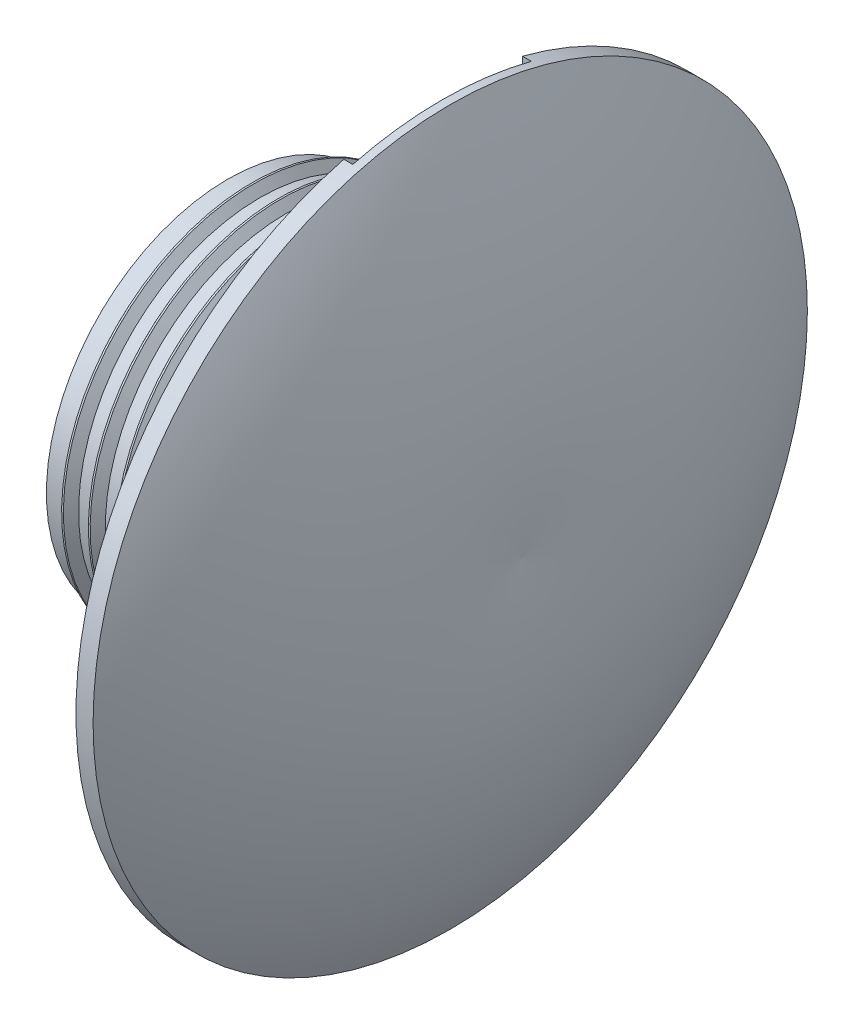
ISO-10303-21;
HEADER;
FILE_DESCRIPTION(('STEP AP214'),'2;1');
FILE_NAME('part.step','',(''),(''),'','','');
FILE_SCHEMA(('AUTOMOTIVE_DESIGN { 1 0 10303 214 1 1 1 1 }'));
ENDSEC;
DATA;
#1=APPLICATION_CONTEXT('core data for automotive mechanical design processes');
#2=APPLICATION_PROTOCOL_DEFINITION('international standard','automotive_design',2000,#1);
#3=PRODUCT_CONTEXT('',#1,'mechanical');
#4=PRODUCT('Part','Part','',(#3));
#5=PRODUCT_RELATED_PRODUCT_CATEGORY('part','',(#4));
#6=PRODUCT_DEFINITION_FORMATION('','',#4);
#7=PRODUCT_DEFINITION_CONTEXT('part definition',#1,'design');
#8=PRODUCT_DEFINITION('design','',#6,#7);
#9=PRODUCT_DEFINITION_SHAPE('','',#8);
#10=(LENGTH_UNIT() NAMED_UNIT(*) SI_UNIT(.MILLI.,.METRE.));
#11=(NAMED_UNIT(*) PLANE_ANGLE_UNIT() SI_UNIT($,.RADIAN.));
#12=(NAMED_UNIT(*) SI_UNIT($,.STERADIAN.) SOLID_ANGLE_UNIT());
#13=UNCERTAINTY_MEASURE_WITH_UNIT(LENGTH_MEASURE(1.E-05),#10,'distance_accuracy_value','');
#14=(GEOMETRIC_REPRESENTATION_CONTEXT(3) GLOBAL_UNCERTAINTY_ASSIGNED_CONTEXT((#13)) GLOBAL_UNIT_ASSIGNED_CONTEXT((#10,
#11,#12)) REPRESENTATION_CONTEXT('',''));
#15=CARTESIAN_POINT('',(0.,0.,0.));
#16=DIRECTION('',(0.,0.,1.));
#17=DIRECTION('',(1.,0.,0.));
#18=AXIS2_PLACEMENT_3D('',#15,#16,#17);
#19=CARTESIAN_POINT('',(13289.4559602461,-2625.68628909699,0.));
#20=DIRECTION('',(1.,0.,0.));
#21=DIRECTION('',(0.,1.,0.));
#22=AXIS2_PLACEMENT_3D('',#19,#20,#21);
#23=SPHERICAL_SURFACE('',#22,400.249999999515);
#24=CARTESIAN_POINT('',(13289.4559602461,-2625.68628909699,5.));
#25=DIRECTION('',(0.,0.,1.));
#26=DIRECTION('',(0.,-1.,0.));
#27=AXIS2_PLACEMENT_3D('',#24,#25,#26);
#28=CIRCLE('',#27,400.218768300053);
#29=CARTESIAN_POINT('',(13689.2059602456,-2645.05120582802,5.));
#30=VERTEX_POINT('',#29);
#31=CARTESIAN_POINT('',(13689.4521421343,-2639.03233624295,5.));
#32=VERTEX_POINT('',#31);
#33=EDGE_CURVE('E147',#30,#32,#28,.T.);
#34=ORIENTED_EDGE('',*,*,#33,.F.);
#35=CARTESIAN_POINT('',(13689.2059602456,-2625.68628909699,0.));
#36=DIRECTION('',(1.,0.,0.));
#37=DIRECTION('',(0.,1.,0.));
#38=AXIS2_PLACEMENT_3D('',#35,#36,#37);
#39=CIRCLE('',#38,20.);
#40=CARTESIAN_POINT('',(13689.2059602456,-2606.32137236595,5.));
#41=VERTEX_POINT('',#40);
#42=EDGE_CURVE('E123',#41,#30,#39,.T.);
#43=ORIENTED_EDGE('',*,*,#42,.F.);
#44=CARTESIAN_POINT('',(13289.4559602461,-2625.68628909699,5.));
#45=DIRECTION('',(0.,0.,1.));
#46=DIRECTION('',(0.,-1.,0.));
#47=AXIS2_PLACEMENT_3D('',#44,#45,#46);
#48=CIRCLE('',#47,400.218768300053);
#49=CARTESIAN_POINT('',(13689.4521421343,-2612.34024195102,5.));
#50=VERTEX_POINT('',#49);
#51=EDGE_CURVE('E192',#50,#41,#48,.T.);
#52=ORIENTED_EDGE('',*,*,#51,.F.);
#53=CARTESIAN_POINT('',(13689.4521421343,-2625.68628909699,0.));
#54=DIRECTION('',(-1.,0.,0.));
#55=DIRECTION('',(0.,0.,1.));
#56=AXIS2_PLACEMENT_3D('',#53,#54,#55);
#57=CIRCLE('',#56,14.2519112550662);
#58=EDGE_CURVE('E293',#32,#50,#57,.T.);
#59=ORIENTED_EDGE('',*,*,#58,.F.);
#60=EDGE_LOOP('',(#34,#43,#52,#59));
#61=FACE_BOUND('',#60,.T.);
#62=ADVANCED_FACE('F16',(#61),#23,.F.);
#63=CARTESIAN_POINT('',(13289.4559602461,-2645.59565459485,0.));
#64=DIRECTION('',(0.,-1.,0.));
#65=DIRECTION('',(1.,0.,0.));
#66=AXIS2_PLACEMENT_3D('',#63,#64,#65);
#67=CIRCLE('',#66,399.75452425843);
#68=CARTESIAN_POINT('',(13689.2059602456,-2645.59565459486,-1.90188471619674));
#69=VERTEX_POINT('',#68);
#70=CARTESIAN_POINT('',(13689.2059602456,-2645.59565459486,1.90188471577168));
#71=VERTEX_POINT('',#70);
#72=EDGE_CURVE('E144',#69,#71,#67,.T.);
#73=ORIENTED_EDGE('',*,*,#72,.F.);
#74=EDGE_CURVE('E140',#71,#69,#39,.T.);
#75=ORIENTED_EDGE('',*,*,#74,.F.);
#76=EDGE_LOOP('',(#73,#75));
#77=FACE_BOUND('',#76,.T.);
#78=ADVANCED_FACE('F146',(#77),#23,.F.);
#79=CARTESIAN_POINT('',(13677.7059602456,-2615.53224576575,0.));
#80=DIRECTION('',(1.,0.,0.));
#81=DIRECTION('',(0.,1.,0.));
#82=AXIS2_PLACEMENT_3D('',#79,#80,#81);
#83=PLANE('',#82);
#84=CARTESIAN_POINT('',(13677.7059602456,-2625.68628909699,0.));
#85=DIRECTION('',(-1.,0.,0.));
#86=DIRECTION('',(0.,-1.,0.));
#87=AXIS2_PLACEMENT_3D('',#84,#85,#86);
#88=CIRCLE('',#87,10.1540433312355);
#89=CARTESIAN_POINT('',(13677.7059602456,-2635.84033242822,0.));
#90=VERTEX_POINT('',#89);
#91=EDGE_CURVE('E209',#90,#90,#88,.T.);
#92=ORIENTED_EDGE('',*,*,#91,.T.);
#93=EDGE_LOOP('',(#92));
#94=FACE_BOUND('',#93,.T.);
#95=CARTESIAN_POINT('',(13677.7059602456,-2625.68628909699,0.));
#96=DIRECTION('',(1.,0.,0.));
#97=DIRECTION('',(0.,1.,0.));
#98=AXIS2_PLACEMENT_3D('',#95,#96,#97);
#99=CIRCLE('',#98,7.61404333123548);
#100=CARTESIAN_POINT('',(13677.7059602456,-2618.07224576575,0.));
#101=VERTEX_POINT('',#100);
#102=EDGE_CURVE('E200',#101,#101,#99,.F.);
#103=ORIENTED_EDGE('',*,*,#102,.F.);
#104=EDGE_LOOP('',(#103));
#105=FACE_BOUND('',#104,.T.);
#106=ADVANCED_FACE('F333',(#94,#105),#83,.F.);
#107=CARTESIAN_POINT('',(13659.3415936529,-2625.68628909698,0.));
#108=DIRECTION('',(1.,0.,0.));
#109=DIRECTION('',(0.,1.,0.));
#110=AXIS2_PLACEMENT_3D('',#107,#108,#109);
#111=DEGENERATE_TOROIDAL_SURFACE('',#110,3.41886597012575,31.9999999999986,.T.);
#112=CARTESIAN_POINT('',(13689.7059602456,-2625.68628909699,0.));
#113=DIRECTION('',(-1.,0.,0.));
#114=DIRECTION('',(0.,-1.,0.));
#115=AXIS2_PLACEMENT_3D('',#112,#113,#114);
#116=CIRCLE('',#115,13.5186303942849);
#117=CARTESIAN_POINT('',(13689.7059602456,-2638.24627985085,5.));
#118=VERTEX_POINT('',#117);
#119=CARTESIAN_POINT('',(13689.7059602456,-2638.24627985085,-5.));
#120=VERTEX_POINT('',#119);
#121=EDGE_CURVE('E136',#118,#120,#116,.F.);
#122=ORIENTED_EDGE('',*,*,#121,.F.);
#123=CARTESIAN_POINT('',(13689.8963509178,-2637.60729217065,5.));
#124=CARTESIAN_POINT('',(13689.7708930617,-2638.04447635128,5.));
#125=CARTESIAN_POINT('',(13689.636389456,-2638.4790653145,5.));
#126=CARTESIAN_POINT('',(13689.3493496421,-2639.34225602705,5.));
#127=CARTESIAN_POINT('',(13689.1968120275,-2639.77085730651,5.));
#128=CARTESIAN_POINT('',(13688.7122672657,-2641.04662884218,5.));
#129=CARTESIAN_POINT('',(13688.3533293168,-2641.88376289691,5.));
#130=CARTESIAN_POINT('',(13687.5645753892,-2643.52691283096,5.));
#131=CARTESIAN_POINT('',(13687.1345505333,-2644.33282809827,5.));
#132=CARTESIAN_POINT('',(13686.2071599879,-2645.90492928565,5.));
#133=CARTESIAN_POINT('',(13685.7097975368,-2646.67111711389,5.));
#134=CARTESIAN_POINT('',(13684.6513659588,-2648.15774773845,5.));
#135=CARTESIAN_POINT('',(13684.0903187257,-2648.87820612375,5.));
#136=CARTESIAN_POINT('',(13682.9083892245,-2650.26827049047,5.));
#137=CARTESIAN_POINT('',(13682.2875062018,-2650.9378758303,5.));
#138=CARTESIAN_POINT('',(13680.9910895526,-2652.22054398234,5.));
#139=CARTESIAN_POINT('',(13680.3156115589,-2652.83366302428,5.));
#140=CARTESIAN_POINT('',(13678.914423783,-2653.99951717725,5.));
#141=CARTESIAN_POINT('',(13678.1887148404,-2654.55225329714,5.));
#142=CARTESIAN_POINT('',(13676.7069954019,-2655.58306639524,5.));
#143=CARTESIAN_POINT('',(13675.9518499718,-2656.06238744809,5.));
#144=CARTESIAN_POINT('',(13674.403787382,-2656.95554923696,5.));
#145=CARTESIAN_POINT('',(13673.6108707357,-2657.36939086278,5.));
#146=CARTESIAN_POINT('',(13671.9927487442,-2658.12869567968,5.));
#147=CARTESIAN_POINT('',(13671.1675367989,-2658.47414480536,5.));
#148=CARTESIAN_POINT('',(13669.4908690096,-2659.09407197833,5.));
#149=CARTESIAN_POINT('',(13668.6394131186,-2659.3685498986,5.));
#150=CARTESIAN_POINT('',(13666.9187624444,-2659.84389001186,5.));
#151=CARTESIAN_POINT('',(13666.0496239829,-2660.04495610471,5.));
#152=CARTESIAN_POINT('',(13664.2974930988,-2660.37310736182,5.));
#153=CARTESIAN_POINT('',(13663.4145007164,-2660.50019274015,5.));
#154=CARTESIAN_POINT('',(13661.6409350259,-2660.67947414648,5.));
#155=CARTESIAN_POINT('',(13660.7503616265,-2660.73166927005,5.));
#156=CARTESIAN_POINT('',(13658.9679844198,-2660.7607935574,5.));
#157=CARTESIAN_POINT('',(13658.076180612,-2660.73772269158,5.));
#158=CARTESIAN_POINT('',(13656.2981843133,-2660.6165137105,5.));
#159=CARTESIAN_POINT('',(13655.411988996,-2660.51841704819,5.));
#160=CARTESIAN_POINT('',(13653.6510149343,-2660.24790773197,5.));
#161=CARTESIAN_POINT('',(13652.7762361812,-2660.07549513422,5.));
#162=CARTESIAN_POINT('',(13651.0445532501,-2659.65764519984,5.));
#163=CARTESIAN_POINT('',(13650.1876441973,-2659.4122280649,5.));
#164=CARTESIAN_POINT('',(13648.4975364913,-2658.85010645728,5.));
#165=CARTESIAN_POINT('',(13647.6643378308,-2658.53340200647,5.));
#166=CARTESIAN_POINT('',(13646.0277387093,-2657.83104592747,5.));
#167=CARTESIAN_POINT('',(13645.2243318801,-2657.44540913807,5.));
#168=CARTESIAN_POINT('',(13643.6528185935,-2656.60789921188,5.));
#169=CARTESIAN_POINT('',(13642.8847121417,-2656.15602606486,5.));
#170=CARTESIAN_POINT('',(13641.3885356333,-2655.18882447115,5.));
#171=CARTESIAN_POINT('',(13640.6605034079,-2654.67343750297,5.));
#172=CARTESIAN_POINT('',(13639.2503884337,-2653.5832321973,5.));
#173=CARTESIAN_POINT('',(13638.5683057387,-2653.00841379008,5.));
#174=CARTESIAN_POINT('',(13637.2536642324,-2651.80234209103,5.));
#175=CARTESIAN_POINT('',(13636.6211999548,-2651.17098575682,5.));
#176=CARTESIAN_POINT('',(13635.4116379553,-2649.85729174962,5.));
#177=CARTESIAN_POINT('',(13634.8345405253,-2649.17495380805,5.));
#178=CARTESIAN_POINT('',(13633.7411071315,-2647.76600915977,5.));
#179=CARTESIAN_POINT('',(13633.2246202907,-2647.03951951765,5.));
#180=CARTESIAN_POINT('',(13632.2542076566,-2645.54592886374,5.));
#181=CARTESIAN_POINT('',(13631.8002796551,-2644.77882928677,5.));
#182=CARTESIAN_POINT('',(13630.9567697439,-2643.20742073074,5.));
#183=CARTESIAN_POINT('',(13630.5673637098,-2642.40301745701,5.));
#184=CARTESIAN_POINT('',(13629.8565861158,-2640.76445492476,5.));
#185=CARTESIAN_POINT('',(13629.535224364,-2639.93029139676,5.));
#186=CARTESIAN_POINT('',(13629.1046842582,-2638.65951924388,5.));
#187=CARTESIAN_POINT('',(13628.9694746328,-2638.2315512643,5.));
#188=CARTESIAN_POINT('',(13628.7166474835,-2637.37041463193,5.));
#189=CARTESIAN_POINT('',(13628.5990302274,-2636.93724590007,5.));
#190=CARTESIAN_POINT('',(13628.3814381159,-2636.06681877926,5.));
#191=CARTESIAN_POINT('',(13628.2814515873,-2635.6295632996,5.));
#192=CARTESIAN_POINT('',(13628.0988343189,-2634.75145152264,5.));
#193=CARTESIAN_POINT('',(13628.0162032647,-2634.3105952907,5.));
#194=CARTESIAN_POINT('',(13627.8784799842,-2633.48920600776,5.));
#195=CARTESIAN_POINT('',(13627.8211403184,-2633.10904691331,5.));
#196=CARTESIAN_POINT('',(13627.7184719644,-2632.34709566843,5.));
#197=CARTESIAN_POINT('',(13627.6731438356,-2631.96530344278,5.));
#198=CARTESIAN_POINT('',(13627.5938084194,-2631.20045329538,5.));
#199=CARTESIAN_POINT('',(13627.5598040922,-2630.81739506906,5.));
#200=CARTESIAN_POINT('',(13627.5021027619,-2630.05051921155,5.));
#201=CARTESIAN_POINT('',(13627.4784056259,-2629.66670159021,5.));
#202=CARTESIAN_POINT('',(13627.439801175,-2628.89750140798,5.));
#203=CARTESIAN_POINT('',(13627.4249200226,-2628.51211757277,5.));
#204=CARTESIAN_POINT('',(13627.4021951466,-2627.7411474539,5.));
#205=CARTESIAN_POINT('',(13627.3943515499,-2627.35556116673,5.));
#206=CARTESIAN_POINT('',(13627.3838754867,-2626.58428481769,5.));
#207=CARTESIAN_POINT('',(13627.3812435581,-2626.19859474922,5.));
#208=CARTESIAN_POINT('',(13627.3802746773,-2625.4272058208,5.));
#209=CARTESIAN_POINT('',(13627.3819377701,-2625.04150696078,5.));
#210=CARTESIAN_POINT('',(13627.3901589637,-2624.27072119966,5.));
#211=CARTESIAN_POINT('',(13627.3967098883,-2623.88563422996,5.));
#212=CARTESIAN_POINT('',(13627.4164007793,-2623.1156400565,5.));
#213=CARTESIAN_POINT('',(13627.4295403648,-2622.73073284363,5.));
#214=CARTESIAN_POINT('',(13627.4643047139,-2621.96138129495,5.));
#215=CARTESIAN_POINT('',(13627.4859274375,-2621.57693687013,5.));
#216=CARTESIAN_POINT('',(13627.539222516,-2620.80873174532,5.));
#217=CARTESIAN_POINT('',(13627.5708949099,-2620.424971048,5.));
#218=CARTESIAN_POINT('',(13627.6452837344,-2619.65985240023,5.));
#219=CARTESIAN_POINT('',(13627.6879615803,-2619.27849073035,5.));
#220=CARTESIAN_POINT('',(13627.785161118,-2618.51726744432,5.));
#221=CARTESIAN_POINT('',(13627.8396829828,-2618.13740585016,5.));
#222=CARTESIAN_POINT('',(13627.9610488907,-2617.37967814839,5.));
#223=CARTESIAN_POINT('',(13628.0278920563,-2617.00181190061,5.));
#224=CARTESIAN_POINT('',(13628.1741984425,-2616.24853039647,5.));
#225=CARTESIAN_POINT('',(13628.2536616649,-2615.87311514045,5.));
#226=CARTESIAN_POINT('',(13628.4410782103,-2615.05683697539,5.));
#227=CARTESIAN_POINT('',(13628.551584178,-2614.6165570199,5.));
#228=CARTESIAN_POINT('',(13628.7905880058,-2613.74095905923,5.));
#229=CARTESIAN_POINT('',(13628.9190840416,-2613.30564055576,5.));
#230=CARTESIAN_POINT('',(13629.1942226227,-2612.44020499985,5.));
#231=CARTESIAN_POINT('',(13629.3408861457,-2612.01009460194,5.));
#232=CARTESIAN_POINT('',(13629.6521090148,-2611.15641831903,5.));
#233=CARTESIAN_POINT('',(13629.8166687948,-2610.73285259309,5.));
#234=CARTESIAN_POINT('',(13630.3358577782,-2609.47577049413,5.));
#235=CARTESIAN_POINT('',(13630.7169152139,-2608.65297694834,5.));
#236=CARTESIAN_POINT('',(13631.5470905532,-2607.04301549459,5.));
#237=CARTESIAN_POINT('',(13631.9961812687,-2606.25583351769,5.));
#238=CARTESIAN_POINT('',(13632.9604198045,-2604.72116432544,5.));
#239=CARTESIAN_POINT('',(13633.4756752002,-2603.97374462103,5.));
#240=CARTESIAN_POINT('',(13634.5681456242,-2602.52548960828,5.));
#241=CARTESIAN_POINT('',(13635.1453693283,-2601.82466084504,5.));
#242=CARTESIAN_POINT('',(13636.3585823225,-2600.47380900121,5.));
#243=CARTESIAN_POINT('',(13636.9946647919,-2599.82386959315,5.));
#244=CARTESIAN_POINT('',(13638.3201619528,-2598.58092675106,5.));
#245=CARTESIAN_POINT('',(13639.0095738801,-2597.98792036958,5.));
#246=CARTESIAN_POINT('',(13640.426015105,-2596.87165690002,5.));
#247=CARTESIAN_POINT('',(13641.1523258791,-2596.34748776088,5.));
#248=CARTESIAN_POINT('',(13642.6466633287,-2595.36242122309,5.));
#249=CARTESIAN_POINT('',(13643.4146900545,-2594.90152390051,5.));
#250=CARTESIAN_POINT('',(13644.9864333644,-2594.04662576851,5.));
#251=CARTESIAN_POINT('',(13645.7901252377,-2593.65257952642,5.));
#252=CARTESIAN_POINT('',(13647.4279431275,-2592.93384223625,5.));
#253=CARTESIAN_POINT('',(13648.2620690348,-2592.60915093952,5.));
#254=CARTESIAN_POINT('',(13649.9520766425,-2592.0323888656,5.));
#255=CARTESIAN_POINT('',(13650.8078801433,-2591.78008892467,5.));
#256=CARTESIAN_POINT('',(13652.5377096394,-2591.34853265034,5.));
#257=CARTESIAN_POINT('',(13653.4117356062,-2591.16927620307,5.));
#258=CARTESIAN_POINT('',(13655.1719925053,-2590.88505797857,5.));
#259=CARTESIAN_POINT('',(13656.0582262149,-2590.78011340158,5.));
#260=CARTESIAN_POINT('',(13657.8363871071,-2590.64533826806,5.));
#261=CARTESIAN_POINT('',(13658.7283142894,-2590.6155077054,5.));
#262=CARTESIAN_POINT('',(13660.5106948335,-2590.63116712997,5.));
#263=CARTESIAN_POINT('',(13661.401148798,-2590.67658861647,5.));
#264=CARTESIAN_POINT('',(13663.1750627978,-2590.84229721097,5.));
#265=CARTESIAN_POINT('',(13664.0585228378,-2590.96258426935,5.));
#266=CARTESIAN_POINT('',(13665.812010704,-2591.27713541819,5.));
#267=CARTESIAN_POINT('',(13666.6820408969,-2591.47138631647,5.));
#268=CARTESIAN_POINT('',(13668.4026475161,-2591.93247746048,5.));
#269=CARTESIAN_POINT('',(13669.2532239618,-2592.19931763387,5.));
#270=CARTESIAN_POINT('',(13670.9287893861,-2592.80364501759,5.));
#271=CARTESIAN_POINT('',(13671.7537812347,-2593.1411242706,5.));
#272=CARTESIAN_POINT('',(13673.372428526,-2593.88433589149,5.));
#273=CARTESIAN_POINT('',(13674.1660838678,-2594.29006847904,5.));
#274=CARTESIAN_POINT('',(13675.7167276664,-2595.1670507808,5.));
#275=CARTESIAN_POINT('',(13676.4737021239,-2595.6383252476,5.));
#276=CARTESIAN_POINT('',(13677.9452997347,-2596.64289591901,5.));
#277=CARTESIAN_POINT('',(13678.659923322,-2597.17619148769,5.));
#278=CARTESIAN_POINT('',(13680.0425286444,-2598.30159287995,5.));
#279=CARTESIAN_POINT('',(13680.710459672,-2598.89376099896,5.));
#280=CARTESIAN_POINT('',(13681.9941658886,-2600.13220326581,5.));
#281=CARTESIAN_POINT('',(13682.6099391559,-2600.77847940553,5.));
#282=CARTESIAN_POINT('',(13683.7845099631,-2602.11991103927,5.));
#283=CARTESIAN_POINT('',(13684.3433553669,-2602.81502462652,5.));
#284=CARTESIAN_POINT('',(13685.4007669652,-2604.2495465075,5.));
#285=CARTESIAN_POINT('',(13685.8993401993,-2604.98894961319,5.));
#286=CARTESIAN_POINT('',(13686.8342976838,-2606.50901701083,5.));
#287=CARTESIAN_POINT('',(13687.2704990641,-2607.28979379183,5.));
#288=CARTESIAN_POINT('',(13688.0763571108,-2608.88524982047,5.));
#289=CARTESIAN_POINT('',(13688.4459913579,-2609.69994037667,5.));
#290=CARTESIAN_POINT('',(13689.1169031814,-2611.35824131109,5.));
#291=CARTESIAN_POINT('',(13689.4180974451,-2612.20188551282,5.));
#292=CARTESIAN_POINT('',(13689.8171828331,-2613.48308122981,5.));
#293=CARTESIAN_POINT('',(13689.9413916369,-2613.91261021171,5.));
#294=CARTESIAN_POINT('',(13690.1723699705,-2614.77638480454,5.));
#295=CARTESIAN_POINT('',(13690.2791378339,-2615.21063086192,5.));
#296=CARTESIAN_POINT('',(13690.5230622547,-2616.29541360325,5.));
#297=CARTESIAN_POINT('',(13690.6497148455,-2616.94834680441,5.));
#298=CARTESIAN_POINT('',(13690.8117824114,-2617.93221507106,5.));
#299=CARTESIAN_POINT('',(13690.8611550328,-2618.26093446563,5.));
#300=CARTESIAN_POINT('',(13690.9509071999,-2618.91959714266,5.));
#301=CARTESIAN_POINT('',(13690.9912870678,-2619.24954038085,5.));
#302=CARTESIAN_POINT('',(13691.0635525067,-2619.91111385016,5.));
#303=CARTESIAN_POINT('',(13691.0954183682,-2620.24274621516,5.));
#304=CARTESIAN_POINT('',(13691.1511437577,-2620.90667815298,5.));
#305=CARTESIAN_POINT('',(13691.1750032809,-2621.23897772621,5.));
#306=CARTESIAN_POINT('',(13691.2155562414,-2621.90404383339,5.));
#307=CARTESIAN_POINT('',(13691.2322488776,-2622.23681041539,5.));
#308=CARTESIAN_POINT('',(13691.2595482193,-2622.90258819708,5.));
#309=CARTESIAN_POINT('',(13691.2701548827,-2623.23559939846,5.));
#310=CARTESIAN_POINT('',(13691.2865303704,-2623.90222090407,5.));
#311=CARTESIAN_POINT('',(13691.2922921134,-2624.23583137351,5.));
#312=CARTESIAN_POINT('',(13691.30005587,-2624.90309407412,5.));
#313=CARTESIAN_POINT('',(13691.3020578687,-2625.23674630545,5.));
#314=CARTESIAN_POINT('',(13691.302824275,-2625.90407456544,5.));
#315=CARTESIAN_POINT('',(13691.3015884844,-2626.23775059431,5.));
#316=CARTESIAN_POINT('',(13691.2955452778,-2626.90507118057,5.));
#317=CARTESIAN_POINT('',(13691.2907378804,-2627.23871573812,5.));
#318=CARTESIAN_POINT('',(13691.2765528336,-2627.90538371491,5.));
#319=CARTESIAN_POINT('',(13691.2671824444,-2628.23840728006,5.));
#320=CARTESIAN_POINT('',(13691.2426361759,-2628.90424890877,5.));
#321=CARTESIAN_POINT('',(13691.2274602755,-2629.23706697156,5.));
#322=CARTESIAN_POINT('',(13691.1901758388,-2629.90221955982,5.));
#323=CARTESIAN_POINT('',(13691.1680694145,-2630.23455420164,5.));
#324=CARTESIAN_POINT('',(13691.1160267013,-2630.89860337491,5.));
#325=CARTESIAN_POINT('',(13691.0860907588,-2631.23031793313,5.));
#326=CARTESIAN_POINT('',(13691.0255287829,-2631.81733002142,5.));
#327=CARTESIAN_POINT('',(13690.9966166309,-2632.07280495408,5.));
#328=CARTESIAN_POINT('',(13690.9335161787,-2632.58311370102,5.));
#329=CARTESIAN_POINT('',(13690.8993276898,-2632.83794749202,5.));
#330=CARTESIAN_POINT('',(13690.825507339,-2633.34682926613,5.));
#331=CARTESIAN_POINT('',(13690.7858754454,-2633.60087724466,5.));
#332=CARTESIAN_POINT('',(13690.7010495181,-2634.10803579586,5.));
#333=CARTESIAN_POINT('',(13690.6558555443,-2634.36114637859,5.));
#334=CARTESIAN_POINT('',(13690.5120248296,-2635.11762627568,5.));
#335=CARTESIAN_POINT('',(13690.4049548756,-2635.61942294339,5.));
#336=CARTESIAN_POINT('',(13690.1678804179,-2636.61767870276,5.));
#337=CARTESIAN_POINT('',(13690.0378707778,-2637.11413657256,5.));
#338=CARTESIAN_POINT('',(13689.8963509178,-2637.60729217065,5.));
#339=B_SPLINE_CURVE_WITH_KNOTS('',3,(#123,#124,#125,#126,#127,#128,#129,#130,#131,#132,#133,
#134,#135,#136,#137,#138,#139,#140,#141,#142,#143,#144,#145,#146,#147,#148,#149,#150,#151,#152,
#153,#154,#155,#156,#157,#158,#159,#160,#161,#162,#163,#164,#165,#166,#167,#168,#169,#170,#171,
#172,#173,#174,#175,#176,#177,#178,#179,#180,#181,#182,#183,#184,#185,#186,#187,#188,#189,#190,
#191,#192,#193,#194,#195,#196,#197,#198,#199,#200,#201,#202,#203,#204,#205,#206,#207,#208,#209,
#210,#211,#212,#213,#214,#215,#216,#217,#218,#219,#220,#221,#222,#223,#224,#225,#226,#227,#228,
#229,#230,#231,#232,#233,#234,#235,#236,#237,#238,#239,#240,#241,#242,#243,#244,#245,#246,#247,
#248,#249,#250,#251,#252,#253,#254,#255,#256,#257,#258,#259,#260,#261,#262,#263,#264,#265,#266,
#267,#268,#269,#270,#271,#272,#273,#274,#275,#276,#277,#278,#279,#280,#281,#282,#283,#284,#285,
#286,#287,#288,#289,#290,#291,#292,#293,#294,#295,#296,#297,#298,#299,#300,#301,#302,#303,#304,
#305,#306,#307,#308,#309,#310,#311,#312,#313,#314,#315,#316,#317,#318,#319,#320,#321,#322,#323,
#324,#325,#326,#327,#328,#329,#330,#331,#332,#333,#334,#335,#336,#337,#338),.UNSPECIFIED.,.T.,
.F.,(4,2,2,2,2,2,2,2,2,2,2,2,2,2,2,2,2,2,2,2,2,2,2,2,2,2,2,2,2,2,2,2,2,2,2,2,2,2,2,2,2,2,2,2,2,
2,2,2,2,2,2,2,2,2,2,2,2,2,2,2,2,2,2,2,2,2,2,2,2,2,2,2,2,2,2,2,2,2,2,2,2,2,2,2,2,2,2,2,2,2,2,2,2,
2,2,2,2,2,2,2,2,2,2,2,2,2,2,4),(0.,1.36437467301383,2.72885581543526,5.45783022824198,
8.19497066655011,10.9319795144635,13.6680502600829,16.4041555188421,19.1375069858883,
21.8708127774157,24.5509014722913,27.2309537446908,29.911556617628,32.5921642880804,
35.2652689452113,37.9383658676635,40.6114950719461,43.284625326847,45.9562797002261,
48.6279320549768,51.298845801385,53.9697587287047,56.6400973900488,59.3104364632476,
61.9832546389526,64.6560759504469,67.3338717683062,70.0116816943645,72.6826776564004,
75.3535793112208,78.031645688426,80.710097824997,82.0562459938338,83.4024146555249,
84.7476886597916,86.0929382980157,87.2461224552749,88.3993603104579,89.5528993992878,
90.7064236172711,91.8633541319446,93.0203054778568,94.1773762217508,95.3344591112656,
96.4898465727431,97.6451672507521,98.8002102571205,99.9552577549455,101.10630950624,
102.25737806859,103.408364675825,104.55935144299,105.920770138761,107.282050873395,
108.644918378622,110.007818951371,112.724545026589,115.440188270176,118.160304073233,
120.880801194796,123.605681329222,126.330420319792,129.014328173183,131.698239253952,
134.38031895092,137.062389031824,139.735872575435,142.409351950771,145.083449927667,
147.757547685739,150.42921259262,153.100875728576,155.772062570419,158.44324675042,
161.114130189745,163.78502222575,166.456925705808,169.128801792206,171.803535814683,
174.478368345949,177.150933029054,179.823185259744,182.503118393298,185.183952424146,
187.868032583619,189.20910517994,190.550305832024,192.544329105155,193.541452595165,
194.538540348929,195.537916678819,196.537293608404,197.536782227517,198.5362777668,
199.537231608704,200.538189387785,201.539208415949,202.540222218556,203.539648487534,
204.539078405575,205.538204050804,206.537285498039,207.308551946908,208.079845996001,
208.851144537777,209.622434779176,211.161141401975,212.700192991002),.UNSPECIFIED.);
#340=EDGE_CURVE('E114',#118,#32,#339,.T.);
#341=ORIENTED_EDGE('',*,*,#340,.T.);
#342=ORIENTED_EDGE('',*,*,#58,.T.);
#343=CARTESIAN_POINT('',(13689.8963509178,-2613.76528602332,5.));
#344=CARTESIAN_POINT('',(13690.0320065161,-2614.23799243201,5.));
#345=CARTESIAN_POINT('',(13690.1570678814,-2614.71368894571,5.));
#346=CARTESIAN_POINT('',(13690.3861448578,-2615.67016193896,5.));
#347=CARTESIAN_POINT('',(13690.4901596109,-2616.15093862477,5.));
#348=CARTESIAN_POINT('',(13690.6774090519,-2617.11632593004,5.));
#349=CARTESIAN_POINT('',(13690.7606512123,-2617.60093510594,5.));
#350=CARTESIAN_POINT('',(13690.9070805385,-2618.57317812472,5.));
#351=CARTESIAN_POINT('',(13690.970267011,-2619.0608120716,5.));
#352=CARTESIAN_POINT('',(13691.0781781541,-2620.04150291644,5.));
#353=CARTESIAN_POINT('',(13691.1227724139,-2620.53457401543,5.));
#354=CARTESIAN_POINT('',(13691.1949960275,-2621.52192917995,5.));
#355=CARTESIAN_POINT('',(13691.2226252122,-2622.01621325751,5.));
#356=CARTESIAN_POINT('',(13691.2642965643,-2623.00582010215,5.));
#357=CARTESIAN_POINT('',(13691.2783249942,-2623.50114341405,5.));
#358=CARTESIAN_POINT('',(13691.2921677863,-2624.24425793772,5.));
#359=CARTESIAN_POINT('',(13691.2955820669,-2624.49199489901,5.));
#360=CARTESIAN_POINT('',(13691.3003989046,-2624.98748861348,5.));
#361=CARTESIAN_POINT('',(13691.301801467,-2625.2352453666,5.));
#362=CARTESIAN_POINT('',(13691.3029339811,-2625.79482343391,5.));
#363=CARTESIAN_POINT('',(13691.3021376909,-2626.1066457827,5.));
#364=CARTESIAN_POINT('',(13691.2975123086,-2626.73027045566,5.));
#365=CARTESIAN_POINT('',(13691.2936832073,-2627.04207277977,5.));
#366=CARTESIAN_POINT('',(13691.2822441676,-2627.66559887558,5.));
#367=CARTESIAN_POINT('',(13691.2746343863,-2627.97732265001,5.));
#368=CARTESIAN_POINT('',(13691.2546364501,-2628.600619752,5.));
#369=CARTESIAN_POINT('',(13691.2422483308,-2628.91219308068,5.));
#370=CARTESIAN_POINT('',(13691.2117352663,-2629.53473442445,5.));
#371=CARTESIAN_POINT('',(13691.1936163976,-2629.84570273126,5.));
#372=CARTESIAN_POINT('',(13691.1508283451,-2630.46719293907,5.));
#373=CARTESIAN_POINT('',(13691.1261591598,-2630.77771483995,5.));
#374=CARTESIAN_POINT('',(13691.0696489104,-2631.39809774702,5.));
#375=CARTESIAN_POINT('',(13691.0378081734,-2631.7079587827,5.));
#376=CARTESIAN_POINT('',(13690.9665052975,-2632.32680385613,5.));
#377=CARTESIAN_POINT('',(13690.9270429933,-2632.63578787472,5.));
#378=CARTESIAN_POINT('',(13690.7973908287,-2633.5562437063,5.));
#379=CARTESIAN_POINT('',(13690.6955005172,-2634.16612149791,5.));
#380=CARTESIAN_POINT('',(13690.4588919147,-2635.37951890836,5.));
#381=CARTESIAN_POINT('',(13690.3241710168,-2635.98303801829,5.));
#382=CARTESIAN_POINT('',(13690.0212992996,-2637.18192880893,5.00000000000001));
#383=CARTESIAN_POINT('',(13689.8531345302,-2637.77729697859,5.00000000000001));
#384=CARTESIAN_POINT('',(13689.4834213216,-2638.957475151,5.));
#385=CARTESIAN_POINT('',(13689.2818764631,-2639.54228627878,5.));
#386=CARTESIAN_POINT('',(13688.7471680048,-2640.96072417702,5.));
#387=CARTESIAN_POINT('',(13688.3956564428,-2641.78751758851,5.));
#388=CARTESIAN_POINT('',(13687.6248442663,-2643.40843733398,5.00000000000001));
#389=CARTESIAN_POINT('',(13687.2055685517,-2644.20257553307,5.00000000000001));
#390=CARTESIAN_POINT('',(13686.3000862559,-2645.75564824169,5.00000000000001));
#391=CARTESIAN_POINT('',(13685.8136414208,-2646.51444397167,5.00000000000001));
#392=CARTESIAN_POINT('',(13684.7782322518,-2647.98821383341,5.00000000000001));
#393=CARTESIAN_POINT('',(13684.2292621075,-2648.70318388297,5.));
#394=CARTESIAN_POINT('',(13683.0731082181,-2650.08346731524,5.));
#395=CARTESIAN_POINT('',(13682.4659694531,-2650.7488183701,5.00000000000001));
#396=CARTESIAN_POINT('',(13681.1974354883,-2652.02559151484,5.00000000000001));
#397=CARTESIAN_POINT('',(13680.5360414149,-2652.63701472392,5.00000000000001));
#398=CARTESIAN_POINT('',(13679.1645405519,-2653.80077850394,5.00000000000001));
#399=CARTESIAN_POINT('',(13678.4544933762,-2654.35318932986,5.00000000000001));
#400=CARTESIAN_POINT('',(13676.9900684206,-2655.39574555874,5.00000000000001));
#401=CARTESIAN_POINT('',(13676.2356906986,-2655.88589104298,5.));
#402=CARTESIAN_POINT('',(13674.6932906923,-2656.7972399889,5.));
#403=CARTESIAN_POINT('',(13673.9055314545,-2657.21888871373,5.00000000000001));
#404=CARTESIAN_POINT('',(13672.2972455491,-2657.99421014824,5.00000000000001));
#405=CARTESIAN_POINT('',(13671.4767190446,-2658.34788319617,5.00000000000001));
#406=CARTESIAN_POINT('',(13669.808474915,-2658.98481581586,5.00000000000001));
#407=CARTESIAN_POINT('',(13668.9607486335,-2659.26805271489,5.00000000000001));
#408=CARTESIAN_POINT('',(13667.2444053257,-2659.76192931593,5.00000000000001));
#409=CARTESIAN_POINT('',(13666.3757882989,-2659.97256901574,5.));
#410=CARTESIAN_POINT('',(13664.6257377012,-2660.31936650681,5.));
#411=CARTESIAN_POINT('',(13663.7443354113,-2660.45568217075,5.00000000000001));
#412=CARTESIAN_POINT('',(13661.9731790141,-2660.65354231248,5.00000000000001));
#413=CARTESIAN_POINT('',(13661.0834249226,-2660.7150869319,5.00000000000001));
#414=CARTESIAN_POINT('',(13659.3018992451,-2660.76296464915,5.00000000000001));
#415=CARTESIAN_POINT('',(13658.4101276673,-2660.74929805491,5.00000000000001));
#416=CARTESIAN_POINT('',(13656.6309090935,-2660.64685189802,5.00000000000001));
#417=CARTESIAN_POINT('',(13655.7434620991,-2660.55807230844,5.));
#418=CARTESIAN_POINT('',(13653.9794836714,-2660.3060749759,5.));
#419=CARTESIAN_POINT('',(13653.1029489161,-2660.1428804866,5.00000000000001));
#420=CARTESIAN_POINT('',(13651.3667446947,-2659.7432281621,5.00000000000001));
#421=CARTESIAN_POINT('',(13650.5070752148,-2659.50677038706,5.00000000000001));
#422=CARTESIAN_POINT('',(13648.8109825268,-2658.962370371,5.00000000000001));
#423=CARTESIAN_POINT('',(13647.9745519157,-2658.6544511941,5.00000000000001));
#424=CARTESIAN_POINT('',(13646.3305847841,-2657.96928998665,5.00000000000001));
#425=CARTESIAN_POINT('',(13645.5230482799,-2657.59204791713,5.));
#426=CARTESIAN_POINT('',(13643.9426701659,-2656.77097502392,5.));
#427=CARTESIAN_POINT('',(13643.1698248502,-2656.32715133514,5.00000000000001));
#428=CARTESIAN_POINT('',(13641.6642340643,-2655.37608797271,5.00000000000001));
#429=CARTESIAN_POINT('',(13640.9314884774,-2654.8688484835,5.00000000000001));
#430=CARTESIAN_POINT('',(13639.510392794,-2653.79389692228,5.00000000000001));
#431=CARTESIAN_POINT('',(13638.8220913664,-2653.22612030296,5.00000000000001));
#432=CARTESIAN_POINT('',(13637.8274776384,-2652.33274878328,5.00000000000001));
#433=CARTESIAN_POINT('',(13637.5022297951,-2652.02798981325,5.00000000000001));
#434=CARTESIAN_POINT('',(13636.8647538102,-2651.40498446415,5.00000000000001));
#435=CARTESIAN_POINT('',(13636.5525289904,-2651.08673468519,5.));
#436=CARTESIAN_POINT('',(13635.6350630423,-2650.11132906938,5.));
#437=CARTESIAN_POINT('',(13635.0503274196,-2649.43468209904,5.));
#438=CARTESIAN_POINT('',(13633.9398434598,-2648.03460203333,5.00000000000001));
#439=CARTESIAN_POINT('',(13633.414095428,-2647.3111686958,5.00000000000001));
#440=CARTESIAN_POINT('',(13632.6731708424,-2646.19608353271,5.00000000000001));
#441=CARTESIAN_POINT('',(13632.434426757,-2645.81991071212,5.00000000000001));
#442=CARTESIAN_POINT('',(13631.9729233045,-2645.05801558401,5.00000000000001));
#443=CARTESIAN_POINT('',(13631.7501598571,-2644.67229574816,5.00000000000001));
#444=CARTESIAN_POINT('',(13631.1062465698,-2643.50159213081,5.00000000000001));
#445=CARTESIAN_POINT('',(13630.7094609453,-2642.70304490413,5.));
#446=CARTESIAN_POINT('',(13629.9819156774,-2641.07232590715,5.));
#447=CARTESIAN_POINT('',(13629.6514462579,-2640.24002471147,5.));
#448=CARTESIAN_POINT('',(13629.2080571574,-2638.97353871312,5.00000000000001));
#449=CARTESIAN_POINT('',(13629.0689736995,-2638.54834693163,5.00000000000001));
#450=CARTESIAN_POINT('',(13628.8082904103,-2637.69264691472,5.00000000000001));
#451=CARTESIAN_POINT('',(13628.6866892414,-2637.26213908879,5.00000000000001));
#452=CARTESIAN_POINT('',(13628.4604117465,-2636.39446856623,5.00000000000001));
#453=CARTESIAN_POINT('',(13628.355820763,-2635.95728366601,5.00000000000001));
#454=CARTESIAN_POINT('',(13628.164130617,-2635.07908960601,5.00000000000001));
#455=CARTESIAN_POINT('',(13628.0770318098,-2634.6380803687,5.));
#456=CARTESIAN_POINT('',(13627.9199921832,-2633.75306135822,5.));
#457=CARTESIAN_POINT('',(13627.8500500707,-2633.30905181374,5.00000000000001));
#458=CARTESIAN_POINT('',(13627.7266895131,-2632.41877658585,5.));
#459=CARTESIAN_POINT('',(13627.6732700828,-2631.97251103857,5.));
#460=CARTESIAN_POINT('',(13627.595358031,-2631.21046733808,5.));
#461=CARTESIAN_POINT('',(13627.5669817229,-2630.89507732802,5.));
#462=CARTESIAN_POINT('',(13627.5173113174,-2630.26373537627,5.00000000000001));
#463=CARTESIAN_POINT('',(13627.4960173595,-2629.94778342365,5.));
#464=CARTESIAN_POINT('',(13627.4597498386,-2629.31546074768,5.));
#465=CARTESIAN_POINT('',(13627.4447775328,-2628.99908995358,5.));
#466=CARTESIAN_POINT('',(13627.4202008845,-2628.36614533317,5.));
#467=CARTESIAN_POINT('',(13627.4105965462,-2628.0495715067,5.));
#468=CARTESIAN_POINT('',(13627.3956823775,-2627.41589432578,5.));
#469=CARTESIAN_POINT('',(13627.3903784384,-2627.09879083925,5.));
#470=CARTESIAN_POINT('',(13627.3831547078,-2626.46454680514,5.));
#471=CARTESIAN_POINT('',(13627.3812349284,-2626.14740625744,5.));
#472=CARTESIAN_POINT('',(13627.3803298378,-2625.51312725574,5.));
#473=CARTESIAN_POINT('',(13627.3813444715,-2625.19598880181,5.));
#474=CARTESIAN_POINT('',(13627.3865555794,-2624.56173666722,5.));
#475=CARTESIAN_POINT('',(13627.390752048,-2624.2446229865,5.));
#476=CARTESIAN_POINT('',(13627.4031351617,-2623.61120511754,5.));
#477=CARTESIAN_POINT('',(13627.41131253,-2623.2949007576,5.));
#478=CARTESIAN_POINT('',(13627.4327055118,-2622.66245877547,5.));
#479=CARTESIAN_POINT('',(13627.4459210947,-2622.34632115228,5.));
#480=CARTESIAN_POINT('',(13627.4783915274,-2621.71438386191,5.));
#481=CARTESIAN_POINT('',(13627.4976457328,-2621.39858416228,5.));
#482=CARTESIAN_POINT('',(13627.5430153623,-2620.76747393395,5.));
#483=CARTESIAN_POINT('',(13627.5691307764,-2620.45216340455,5.));
#484=CARTESIAN_POINT('',(13627.6287874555,-2619.82287436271,5.));
#485=CARTESIAN_POINT('',(13627.6623137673,-2619.50889444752,5.));
#486=CARTESIAN_POINT('',(13627.7372638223,-2618.88187787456,5.));
#487=CARTESIAN_POINT('',(13627.7786877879,-2618.56884124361,5.));
#488=CARTESIAN_POINT('',(13627.91531091,-2617.63151957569,5.));
#489=CARTESIAN_POINT('',(13628.0228665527,-2617.00896578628,5.));
#490=CARTESIAN_POINT('',(13628.2375660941,-2615.94334352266,5.));
#491=CARTESIAN_POINT('',(13628.3364759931,-2615.49859309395,5.));
#492=CARTESIAN_POINT('',(13628.5523689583,-2614.61351679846,5.));
#493=CARTESIAN_POINT('',(13628.6693507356,-2614.17319061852,5.));
#494=CARTESIAN_POINT('',(13628.9215717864,-2613.29737808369,5.));
#495=CARTESIAN_POINT('',(13629.0568267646,-2612.8618962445,5.));
#496=CARTESIAN_POINT('',(13629.345452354,-2611.99696647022,5.));
#497=CARTESIAN_POINT('',(13629.4988245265,-2611.56751905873,5.));
#498=CARTESIAN_POINT('',(13629.9853934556,-2610.29086387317,5.));
#499=CARTESIAN_POINT('',(13630.3455085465,-2609.45372233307,5.));
#500=CARTESIAN_POINT('',(13631.1353478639,-2607.81339920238,5.));
#501=CARTESIAN_POINT('',(13631.5650498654,-2607.01020687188,5.));
#502=CARTESIAN_POINT('',(13632.4920301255,-2605.44230324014,5.));
#503=CARTESIAN_POINT('',(13632.9893985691,-2604.6776451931,5.));
#504=CARTESIAN_POINT('',(13634.0478701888,-2603.1936603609,5.));
#505=CARTESIAN_POINT('',(13634.6089808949,-2602.47433894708,5.));
#506=CARTESIAN_POINT('',(13635.7915722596,-2601.08569431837,5.));
#507=CARTESIAN_POINT('',(13636.4131230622,-2600.41643083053,5.));
#508=CARTESIAN_POINT('',(13637.7114826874,-2599.13389806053,5.));
#509=CARTESIAN_POINT('',(13638.3882888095,-2598.52062604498,5.));
#510=CARTESIAN_POINT('',(13639.7790154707,-2597.36559939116,5.));
#511=CARTESIAN_POINT('',(13640.4920010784,-2596.82271855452,5.));
#512=CARTESIAN_POINT('',(13641.9613288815,-2595.79919193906,5.));
#513=CARTESIAN_POINT('',(13642.7176709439,-2595.31854596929,5.));
#514=CARTESIAN_POINT('',(13644.267873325,-2594.42321665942,5.));
#515=CARTESIAN_POINT('',(13645.0617124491,-2594.00849662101,5.));
#516=CARTESIAN_POINT('',(13646.6816242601,-2593.24768927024,5.));
#517=CARTESIAN_POINT('',(13647.5076968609,-2592.90160177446,5.));
#518=CARTESIAN_POINT('',(13649.1830994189,-2592.28168988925,5.));
#519=CARTESIAN_POINT('',(13650.0323336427,-2592.0076067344,5.));
#520=CARTESIAN_POINT('',(13651.7508860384,-2591.53201705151,5.));
#521=CARTESIAN_POINT('',(13652.6202041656,-2591.33051036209,5.));
#522=CARTESIAN_POINT('',(13654.3728702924,-2591.00149200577,5.));
#523=CARTESIAN_POINT('',(13655.2562204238,-2590.87399169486,5.));
#524=CARTESIAN_POINT('',(13657.0305271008,-2590.69394788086,5.));
#525=CARTESIAN_POINT('',(13657.921483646,-2590.6414043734,5.));
#526=CARTESIAN_POINT('',(13659.7037090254,-2590.61166643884,5.));
#527=CARTESIAN_POINT('',(13660.5949765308,-2590.63439231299,5.));
#528=CARTESIAN_POINT('',(13662.372427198,-2590.75485524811,5.));
#529=CARTESIAN_POINT('',(13663.2586103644,-2590.8525922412,5.));
#530=CARTESIAN_POINT('',(13665.0195947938,-2591.12237877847,5.));
#531=CARTESIAN_POINT('',(13665.8943960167,-2591.2944285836,5.));
#532=CARTESIAN_POINT('',(13667.6263952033,-2591.7116101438,5.));
#533=CARTESIAN_POINT('',(13668.4835931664,-2591.95674190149,5.));
#534=CARTESIAN_POINT('',(13670.1743163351,-2592.51834068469,5.));
#535=CARTESIAN_POINT('',(13671.0078409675,-2592.83480943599,5.));
#536=CARTESIAN_POINT('',(13672.6452793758,-2593.53681510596,5.));
#537=CARTESIAN_POINT('',(13673.4491931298,-2593.922352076,5.));
#538=CARTESIAN_POINT('',(13675.0215642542,-2594.759658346,5.));
#539=CARTESIAN_POINT('',(13675.7900281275,-2595.21141543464,5.));
#540=CARTESIAN_POINT('',(13677.2862177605,-2596.17798123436,5.));
#541=CARTESIAN_POINT('',(13678.0139436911,-2596.69278968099,5.));
#542=CARTESIAN_POINT('',(13679.4238962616,-2597.78206172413,5.));
#543=CARTESIAN_POINT('',(13680.1060988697,-2598.35655642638,5.));
#544=CARTESIAN_POINT('',(13681.4198023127,-2599.56087460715,5.));
#545=CARTESIAN_POINT('',(13682.0513022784,-2600.19069903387,5.));
#546=CARTESIAN_POINT('',(13683.259557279,-2601.50156341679,5.));
#547=CARTESIAN_POINT('',(13683.836277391,-2602.18263555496,5.));
#548=CARTESIAN_POINT('',(13684.9305154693,-2603.59073938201,5.));
#549=CARTESIAN_POINT('',(13685.4480372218,-2604.31776812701,5.));
#550=CARTESIAN_POINT('',(13686.3709277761,-2605.73649391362,5.));
#551=CARTESIAN_POINT('',(13686.7823498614,-2606.42426462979,5.));
#552=CARTESIAN_POINT('',(13687.5524548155,-2607.82864572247,5.));
#553=CARTESIAN_POINT('',(13687.9111435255,-2608.54525289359,5.));
#554=CARTESIAN_POINT('',(13688.5730505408,-2610.00091247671,5.));
#555=CARTESIAN_POINT('',(13688.8764382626,-2610.73988796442,5.));
#556=CARTESIAN_POINT('',(13689.4279813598,-2612.23837501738,5.));
#557=CARTESIAN_POINT('',(13689.6761264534,-2612.99789037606,5.));
#558=CARTESIAN_POINT('',(13689.8963509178,-2613.76528602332,5.));
#559=B_SPLINE_CURVE_WITH_KNOTS('',3,(#343,#344,#345,#346,#347,#348,#349,#350,#351,#352,#353,
#354,#355,#356,#357,#358,#359,#360,#361,#362,#363,#364,#365,#366,#367,#368,#369,#370,#371,#372,
#373,#374,#375,#376,#377,#378,#379,#380,#381,#382,#383,#384,#385,#386,#387,#388,#389,#390,#391,
#392,#393,#394,#395,#396,#397,#398,#399,#400,#401,#402,#403,#404,#405,#406,#407,#408,#409,#410,
#411,#412,#413,#414,#415,#416,#417,#418,#419,#420,#421,#422,#423,#424,#425,#426,#427,#428,#429,
#430,#431,#432,#433,#434,#435,#436,#437,#438,#439,#440,#441,#442,#443,#444,#445,#446,#447,#448,
#449,#450,#451,#452,#453,#454,#455,#456,#457,#458,#459,#460,#461,#462,#463,#464,#465,#466,#467,
#468,#469,#470,#471,#472,#473,#474,#475,#476,#477,#478,#479,#480,#481,#482,#483,#484,#485,#486,
#487,#488,#489,#490,#491,#492,#493,#494,#495,#496,#497,#498,#499,#500,#501,#502,#503,#504,#505,
#506,#507,#508,#509,#510,#511,#512,#513,#514,#515,#516,#517,#518,#519,#520,#521,#522,#523,#524,
#525,#526,#527,#528,#529,#530,#531,#532,#533,#534,#535,#536,#537,#538,#539,#540,#541,#542,#543,
#544,#545,#546,#547,#548,#549,#550,#551,#552,#553,#554,#555,#556,#557,#558),.UNSPECIFIED.,.T.,
.F.,(4,2,2,2,2,2,2,2,2,2,2,2,2,2,2,2,2,2,2,2,2,2,2,2,2,2,2,2,2,2,2,2,2,2,2,2,2,2,2,2,2,2,2,2,2,
2,2,2,2,2,2,2,2,2,2,2,2,2,2,2,2,2,2,2,2,2,2,2,2,2,2,2,2,2,2,2,2,2,2,2,2,2,2,2,2,2,2,2,2,2,2,2,2,
2,2,2,2,2,2,2,2,2,2,2,2,2,2,4),(0.,1.47515664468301,2.95037341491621,4.4250587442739,
5.89979505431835,7.38470827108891,8.86963628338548,10.3560625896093,11.0993388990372,
11.8426132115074,12.7780702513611,13.713530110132,14.6489510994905,15.5843651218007,
16.5187906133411,17.4532163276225,18.3875994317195,19.3220028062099,21.176062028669,
23.0302685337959,24.8852500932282,26.7400327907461,29.4319745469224,32.122929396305,
34.8236869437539,37.5246956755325,40.2236323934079,42.9225130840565,45.6181440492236,
48.3137714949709,50.9911066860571,53.6684285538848,56.3466111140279,59.0247937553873,
61.697265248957,64.3697316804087,67.0421871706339,69.7146436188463,72.386265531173,
75.0578852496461,77.7286439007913,80.3994040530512,83.0698782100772,85.7403446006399,
88.4136873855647,89.7505013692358,91.087654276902,93.7671736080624,96.4467068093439,
97.782982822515,99.1189164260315,101.790714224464,104.47396132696,105.815733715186,
107.157403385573,108.505609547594,109.853843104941,111.201975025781,112.550026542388,
113.499939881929,114.449871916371,115.399992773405,116.350114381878,117.301535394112,
118.252959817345,119.204366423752,120.155771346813,121.104969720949,122.054162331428,
123.003253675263,123.95234363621,124.899535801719,125.846754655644,127.741020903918,
129.107529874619,130.473941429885,131.841534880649,133.209246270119,135.939625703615,
138.669134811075,141.402318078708,144.135824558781,146.872542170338,149.609126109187,
152.294351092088,154.979567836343,157.66328455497,160.346994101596,163.020922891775,
165.694845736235,168.369178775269,171.043511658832,173.715013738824,176.386513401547,
179.058022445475,181.729531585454,184.401105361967,187.072681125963,189.743764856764,
192.414837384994,195.087309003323,197.75982642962,200.434036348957,203.108075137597,
205.51016462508,207.911987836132,210.306324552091,212.701106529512),.UNSPECIFIED.);
#560=CARTESIAN_POINT('',(13689.7059602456,-2613.12629834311,5.));
#561=VERTEX_POINT('',#560);
#562=EDGE_CURVE('E185',#50,#561,#559,.T.);
#563=ORIENTED_EDGE('',*,*,#562,.T.);
#564=CARTESIAN_POINT('',(13689.7059602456,-2625.68628909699,0.));
#565=DIRECTION('',(-1.,0.,0.));
#566=DIRECTION('',(0.,-1.,0.));
#567=AXIS2_PLACEMENT_3D('',#564,#565,#566);
#568=CIRCLE('',#567,13.5186303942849);
#569=CARTESIAN_POINT('',(13689.7059602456,-2613.12629834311,-5.));
#570=VERTEX_POINT('',#569);
#571=EDGE_CURVE('E321',#570,#561,#568,.F.);
#572=ORIENTED_EDGE('',*,*,#571,.F.);
#573=CARTESIAN_POINT('',(13689.8963509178,-2613.76528602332,-5.));
#574=CARTESIAN_POINT('',(13689.7708930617,-2613.32810184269,-5.));
#575=CARTESIAN_POINT('',(13689.636389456,-2612.89351287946,-5.));
#576=CARTESIAN_POINT('',(13689.3493496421,-2612.03032216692,-5.));
#577=CARTESIAN_POINT('',(13689.1968120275,-2611.60172088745,-5.));
#578=CARTESIAN_POINT('',(13688.7122672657,-2610.32594935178,-5.));
#579=CARTESIAN_POINT('',(13688.3533293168,-2609.48881529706,-5.));
#580=CARTESIAN_POINT('',(13687.5645753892,-2607.845665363,-5.));
#581=CARTESIAN_POINT('',(13687.1345505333,-2607.0397500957,-5.));
#582=CARTESIAN_POINT('',(13686.2071599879,-2605.46764890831,-5.));
#583=CARTESIAN_POINT('',(13685.7097975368,-2604.70146108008,-5.));
#584=CARTESIAN_POINT('',(13684.6513659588,-2603.21483045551,-5.));
#585=CARTESIAN_POINT('',(13684.0903187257,-2602.49437207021,-5.));
#586=CARTESIAN_POINT('',(13682.9083892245,-2601.1043077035,-5.));
#587=CARTESIAN_POINT('',(13682.2875062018,-2600.43470236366,-5.));
#588=CARTESIAN_POINT('',(13680.9910895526,-2599.15203421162,-5.));
#589=CARTESIAN_POINT('',(13680.3156115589,-2598.53891516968,-5.));
#590=CARTESIAN_POINT('',(13678.914423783,-2597.37306101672,-5.));
#591=CARTESIAN_POINT('',(13678.1887148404,-2596.82032489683,-5.));
#592=CARTESIAN_POINT('',(13676.7069954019,-2595.78951179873,-5.));
#593=CARTESIAN_POINT('',(13675.9518499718,-2595.31019074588,-5.));
#594=CARTESIAN_POINT('',(13674.403787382,-2594.417028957,-5.));
#595=CARTESIAN_POINT('',(13673.6108707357,-2594.00318733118,-5.));
#596=CARTESIAN_POINT('',(13671.9927487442,-2593.24388251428,-5.));
#597=CARTESIAN_POINT('',(13671.1675367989,-2592.8984333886,-5.));
#598=CARTESIAN_POINT('',(13669.4908690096,-2592.27850621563,-5.));
#599=CARTESIAN_POINT('',(13668.6394131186,-2592.00402829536,-5.));
#600=CARTESIAN_POINT('',(13666.9187624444,-2591.5286881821,-5.));
#601=CARTESIAN_POINT('',(13666.0496239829,-2591.32762208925,-5.));
#602=CARTESIAN_POINT('',(13664.2974930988,-2590.99947083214,-5.));
#603=CARTESIAN_POINT('',(13663.4145007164,-2590.87238545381,-5.));
#604=CARTESIAN_POINT('',(13661.640935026,-2590.69310404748,-5.));
#605=CARTESIAN_POINT('',(13660.7503616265,-2590.64090892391,-5.));
#606=CARTESIAN_POINT('',(13658.9679844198,-2590.61178463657,-5.));
#607=CARTESIAN_POINT('',(13658.076180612,-2590.63485550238,-5.));
#608=CARTESIAN_POINT('',(13656.2981843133,-2590.75606448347,-5.));
#609=CARTESIAN_POINT('',(13655.4119889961,-2590.85416114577,-5.));
#610=CARTESIAN_POINT('',(13653.6510149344,-2591.12467046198,-5.));
#611=CARTESIAN_POINT('',(13652.7762361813,-2591.29708305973,-5.));
#612=CARTESIAN_POINT('',(13651.0445532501,-2591.71493299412,-5.));
#613=CARTESIAN_POINT('',(13650.1876441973,-2591.96035012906,-5.));
#614=CARTESIAN_POINT('',(13648.4975364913,-2592.52247173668,-5.));
#615=CARTESIAN_POINT('',(13647.6643378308,-2592.83917618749,-5.));
#616=CARTESIAN_POINT('',(13646.0277387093,-2593.54153226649,-5.));
#617=CARTESIAN_POINT('',(13645.2243318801,-2593.92716905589,-5.));
#618=CARTESIAN_POINT('',(13643.6528185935,-2594.76467898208,-5.));
#619=CARTESIAN_POINT('',(13642.8847121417,-2595.2165521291,-5.));
#620=CARTESIAN_POINT('',(13641.3885356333,-2596.18375372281,-5.));
#621=CARTESIAN_POINT('',(13640.6605034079,-2596.69914069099,-5.));
#622=CARTESIAN_POINT('',(13639.2503884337,-2597.78934599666,-5.));
#623=CARTESIAN_POINT('',(13638.5683057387,-2598.36416440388,-5.));
#624=CARTESIAN_POINT('',(13637.2536642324,-2599.57023610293,-5.));
#625=CARTESIAN_POINT('',(13636.6211999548,-2600.20159243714,-5.));
#626=CARTESIAN_POINT('',(13635.4116379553,-2601.51528644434,-5.));
#627=CARTESIAN_POINT('',(13634.8345405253,-2602.1976243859,-5.));
#628=CARTESIAN_POINT('',(13633.7411071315,-2603.60656903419,-5.));
#629=CARTESIAN_POINT('',(13633.2246202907,-2604.33305867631,-5.));
#630=CARTESIAN_POINT('',(13632.2542076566,-2605.82664933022,-5.));
#631=CARTESIAN_POINT('',(13631.8002796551,-2606.59374890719,-5.));
#632=CARTESIAN_POINT('',(13630.9567697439,-2608.16515746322,-5.));
#633=CARTESIAN_POINT('',(13630.5673637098,-2608.96956073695,-5.));
#634=CARTESIAN_POINT('',(13629.8565861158,-2610.6081232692,-5.));
#635=CARTESIAN_POINT('',(13629.535224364,-2611.4422867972,-5.));
#636=CARTESIAN_POINT('',(13629.1046842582,-2612.71305895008,-5.));
#637=CARTESIAN_POINT('',(13628.9694746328,-2613.14102692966,-5.));
#638=CARTESIAN_POINT('',(13628.7166474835,-2614.00216356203,-5.));
#639=CARTESIAN_POINT('',(13628.5990302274,-2614.43533229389,-5.));
#640=CARTESIAN_POINT('',(13628.3814381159,-2615.3057594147,-5.));
#641=CARTESIAN_POINT('',(13628.2814515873,-2615.74301489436,-5.));
#642=CARTESIAN_POINT('',(13628.0988343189,-2616.62112667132,-5.));
#643=CARTESIAN_POINT('',(13628.0162032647,-2617.06198290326,-5.));
#644=CARTESIAN_POINT('',(13627.8784799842,-2617.8833721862,-5.));
#645=CARTESIAN_POINT('',(13627.8211403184,-2618.26353128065,-5.));
#646=CARTESIAN_POINT('',(13627.7184719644,-2619.02548252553,-5.));
#647=CARTESIAN_POINT('',(13627.6731438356,-2619.40727475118,-5.));
#648=CARTESIAN_POINT('',(13627.5938084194,-2620.17212489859,-5.));
#649=CARTESIAN_POINT('',(13627.5598040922,-2620.5551831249,-5.));
#650=CARTESIAN_POINT('',(13627.5021027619,-2621.32205898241,-5.));
#651=CARTESIAN_POINT('',(13627.4784056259,-2621.70587660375,-5.));
#652=CARTESIAN_POINT('',(13627.439801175,-2622.47507678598,-5.));
#653=CARTESIAN_POINT('',(13627.4249200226,-2622.86046062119,-5.));
#654=CARTESIAN_POINT('',(13627.4021951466,-2623.63143074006,-5.));
#655=CARTESIAN_POINT('',(13627.3943515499,-2624.01701702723,-5.));
#656=CARTESIAN_POINT('',(13627.3838754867,-2624.78829337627,-5.));
#657=CARTESIAN_POINT('',(13627.3812435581,-2625.17398344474,-5.));
#658=CARTESIAN_POINT('',(13627.3802746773,-2625.94537237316,-5.));
#659=CARTESIAN_POINT('',(13627.3819377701,-2626.33107123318,-5.));
#660=CARTESIAN_POINT('',(13627.3901589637,-2627.1018569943,-5.));
#661=CARTESIAN_POINT('',(13627.3967098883,-2627.486943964,-5.));
#662=CARTESIAN_POINT('',(13627.4164007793,-2628.25693813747,-5.));
#663=CARTESIAN_POINT('',(13627.4295403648,-2628.64184535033,-5.));
#664=CARTESIAN_POINT('',(13627.4643047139,-2629.41119689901,-5.));
#665=CARTESIAN_POINT('',(13627.4859274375,-2629.79564132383,-5.));
#666=CARTESIAN_POINT('',(13627.539222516,-2630.56384644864,-5.));
#667=CARTESIAN_POINT('',(13627.5708949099,-2630.94760714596,-5.));
#668=CARTESIAN_POINT('',(13627.6452837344,-2631.71272579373,-5.));
#669=CARTESIAN_POINT('',(13627.6879615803,-2632.09408746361,-5.));
#670=CARTESIAN_POINT('',(13627.785161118,-2632.85531074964,-5.));
#671=CARTESIAN_POINT('',(13627.8396829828,-2633.2351723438,-5.));
#672=CARTESIAN_POINT('',(13627.9610488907,-2633.99290004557,-5.));
#673=CARTESIAN_POINT('',(13628.0278920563,-2634.37076629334,-4.99999999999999));
#674=CARTESIAN_POINT('',(13628.1741984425,-2635.12404779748,-5.));
#675=CARTESIAN_POINT('',(13628.2536616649,-2635.49946305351,-5.));
#676=CARTESIAN_POINT('',(13628.4410782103,-2636.31574121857,-5.));
#677=CARTESIAN_POINT('',(13628.551584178,-2636.75602117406,-5.));
#678=CARTESIAN_POINT('',(13628.7905880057,-2637.63161913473,-4.99999999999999));
#679=CARTESIAN_POINT('',(13628.9190840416,-2638.0669376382,-4.99999999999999));
#680=CARTESIAN_POINT('',(13629.1942226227,-2638.93237319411,-4.99999999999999));
#681=CARTESIAN_POINT('',(13629.3408861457,-2639.36248359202,-4.99999999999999));
#682=CARTESIAN_POINT('',(13629.6521090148,-2640.21615987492,-4.99999999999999));
#683=CARTESIAN_POINT('',(13629.8166687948,-2640.63972560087,-4.99999999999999));
#684=CARTESIAN_POINT('',(13630.3358577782,-2641.89680769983,-4.99999999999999));
#685=CARTESIAN_POINT('',(13630.7169152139,-2642.71960124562,-4.99999999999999));
#686=CARTESIAN_POINT('',(13631.5470905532,-2644.32956269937,-5.));
#687=CARTESIAN_POINT('',(13631.9961812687,-2645.11674467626,-5.));
#688=CARTESIAN_POINT('',(13632.9604198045,-2646.65141386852,-5.));
#689=CARTESIAN_POINT('',(13633.4756752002,-2647.39883357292,-4.99999999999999));
#690=CARTESIAN_POINT('',(13634.5681456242,-2648.84708858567,-4.99999999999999));
#691=CARTESIAN_POINT('',(13635.1453693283,-2649.54791734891,-4.99999999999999));
#692=CARTESIAN_POINT('',(13636.3585823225,-2650.89876919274,-4.99999999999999));
#693=CARTESIAN_POINT('',(13636.9946647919,-2651.5487086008,-4.99999999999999));
#694=CARTESIAN_POINT('',(13638.3201619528,-2652.7916514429,-4.99999999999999));
#695=CARTESIAN_POINT('',(13639.0095738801,-2653.38465782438,-5.));
#696=CARTESIAN_POINT('',(13640.426015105,-2654.50092129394,-5.));
#697=CARTESIAN_POINT('',(13641.152325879,-2655.02509043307,-4.99999999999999));
#698=CARTESIAN_POINT('',(13642.6466633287,-2656.01015697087,-4.99999999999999));
#699=CARTESIAN_POINT('',(13643.4146900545,-2656.47105429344,-4.99999999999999));
#700=CARTESIAN_POINT('',(13644.9864333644,-2657.32595242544,-4.99999999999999));
#701=CARTESIAN_POINT('',(13645.7901252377,-2657.71999866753,-4.99999999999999));
#702=CARTESIAN_POINT('',(13647.4279431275,-2658.4387359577,-4.99999999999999));
#703=CARTESIAN_POINT('',(13648.2620690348,-2658.76342725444,-5.));
#704=CARTESIAN_POINT('',(13649.9520766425,-2659.34018932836,-5.));
#705=CARTESIAN_POINT('',(13650.8078801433,-2659.59248926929,-4.99999999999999));
#706=CARTESIAN_POINT('',(13652.5377096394,-2660.02404554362,-4.99999999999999));
#707=CARTESIAN_POINT('',(13653.4117356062,-2660.20330199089,-4.99999999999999));
#708=CARTESIAN_POINT('',(13655.1719925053,-2660.48752021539,-4.99999999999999));
#709=CARTESIAN_POINT('',(13656.0582262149,-2660.59246479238,-4.99999999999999));
#710=CARTESIAN_POINT('',(13657.8363871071,-2660.7272399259,-4.99999999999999));
#711=CARTESIAN_POINT('',(13658.7283142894,-2660.75707048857,-5.));
#712=CARTESIAN_POINT('',(13660.5106948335,-2660.741411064,-5.));
#713=CARTESIAN_POINT('',(13661.401148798,-2660.69598957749,-4.99999999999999));
#714=CARTESIAN_POINT('',(13663.1750627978,-2660.53028098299,-4.99999999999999));
#715=CARTESIAN_POINT('',(13664.0585228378,-2660.40999392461,-4.99999999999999));
#716=CARTESIAN_POINT('',(13665.812010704,-2660.09544277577,-4.99999999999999));
#717=CARTESIAN_POINT('',(13666.6820408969,-2659.90119187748,-4.99999999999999));
#718=CARTESIAN_POINT('',(13668.4026475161,-2659.44010073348,-4.99999999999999));
#719=CARTESIAN_POINT('',(13669.2532239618,-2659.17326056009,-5.));
#720=CARTESIAN_POINT('',(13670.9287893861,-2658.56893317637,-5.));
#721=CARTESIAN_POINT('',(13671.7537812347,-2658.23145392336,-4.99999999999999));
#722=CARTESIAN_POINT('',(13673.372428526,-2657.48824230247,-4.99999999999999));
#723=CARTESIAN_POINT('',(13674.1660838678,-2657.08250971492,-4.99999999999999));
#724=CARTESIAN_POINT('',(13675.7167276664,-2656.20552741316,-4.99999999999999));
#725=CARTESIAN_POINT('',(13676.4737021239,-2655.73425294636,-4.99999999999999));
#726=CARTESIAN_POINT('',(13677.9452997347,-2654.72968227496,-4.99999999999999));
#727=CARTESIAN_POINT('',(13678.659923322,-2654.19638670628,-5.));
#728=CARTESIAN_POINT('',(13680.0425286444,-2653.07098531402,-5.));
#729=CARTESIAN_POINT('',(13680.710459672,-2652.478817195,-4.99999999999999));
#730=CARTESIAN_POINT('',(13681.9941658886,-2651.24037492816,-4.99999999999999));
#731=CARTESIAN_POINT('',(13682.6099391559,-2650.59409878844,-4.99999999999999));
#732=CARTESIAN_POINT('',(13683.7845099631,-2649.25266715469,-4.99999999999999));
#733=CARTESIAN_POINT('',(13684.3433553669,-2648.55755356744,-4.99999999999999));
#734=CARTESIAN_POINT('',(13685.4007669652,-2647.12303168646,-4.99999999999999));
#735=CARTESIAN_POINT('',(13685.8993401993,-2646.38362858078,-5.));
#736=CARTESIAN_POINT('',(13686.8342976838,-2644.86356118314,-5.));
#737=CARTESIAN_POINT('',(13687.2704990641,-2644.08278440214,-5.));
#738=CARTESIAN_POINT('',(13688.0763571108,-2642.4873283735,-4.99999999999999));
#739=CARTESIAN_POINT('',(13688.4459913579,-2641.6726378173,-4.99999999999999));
#740=CARTESIAN_POINT('',(13689.1169031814,-2640.01433688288,-4.99999999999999));
#741=CARTESIAN_POINT('',(13689.4180974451,-2639.17069268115,-5.));
#742=CARTESIAN_POINT('',(13689.8171828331,-2637.88949696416,-4.99999999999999));
#743=CARTESIAN_POINT('',(13689.9413916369,-2637.45996798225,-4.99999999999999));
#744=CARTESIAN_POINT('',(13690.1723699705,-2636.59619338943,-5.));
#745=CARTESIAN_POINT('',(13690.2791378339,-2636.16194733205,-5.));
#746=CARTESIAN_POINT('',(13690.5230622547,-2635.07716459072,-5.));
#747=CARTESIAN_POINT('',(13690.6497148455,-2634.42423138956,-5.));
#748=CARTESIAN_POINT('',(13690.8117824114,-2633.44036312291,-4.99999999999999));
#749=CARTESIAN_POINT('',(13690.8611550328,-2633.11164372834,-5.));
#750=CARTESIAN_POINT('',(13690.9509071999,-2632.45298105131,-5.));
#751=CARTESIAN_POINT('',(13690.9912870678,-2632.12303781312,-5.));
#752=CARTESIAN_POINT('',(13691.0635525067,-2631.46146434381,-5.));
#753=CARTESIAN_POINT('',(13691.0954183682,-2631.12983197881,-5.));
#754=CARTESIAN_POINT('',(13691.1511437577,-2630.46590004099,-5.));
#755=CARTESIAN_POINT('',(13691.1750032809,-2630.13360046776,-5.));
#756=CARTESIAN_POINT('',(13691.2155562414,-2629.46853436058,-5.));
#757=CARTESIAN_POINT('',(13691.2322488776,-2629.13576777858,-5.));
#758=CARTESIAN_POINT('',(13691.2595482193,-2628.46998999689,-5.));
#759=CARTESIAN_POINT('',(13691.2701548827,-2628.13697879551,-5.));
#760=CARTESIAN_POINT('',(13691.2865303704,-2627.4703572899,-5.));
#761=CARTESIAN_POINT('',(13691.2922921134,-2627.13674682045,-5.));
#762=CARTESIAN_POINT('',(13691.30005587,-2626.46948411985,-5.));
#763=CARTESIAN_POINT('',(13691.3020578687,-2626.13583188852,-5.));
#764=CARTESIAN_POINT('',(13691.302824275,-2625.46850362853,-5.));
#765=CARTESIAN_POINT('',(13691.3015884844,-2625.13482759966,-5.));
#766=CARTESIAN_POINT('',(13691.2955452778,-2624.4675070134,-5.));
#767=CARTESIAN_POINT('',(13691.2907378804,-2624.13386245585,-5.));
#768=CARTESIAN_POINT('',(13691.2765528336,-2623.46719447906,-5.));
#769=CARTESIAN_POINT('',(13691.2671824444,-2623.13417091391,-5.));
#770=CARTESIAN_POINT('',(13691.2426361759,-2622.4683292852,-5.));
#771=CARTESIAN_POINT('',(13691.2274602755,-2622.13551122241,-5.));
#772=CARTESIAN_POINT('',(13691.1901758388,-2621.47035863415,-5.));
#773=CARTESIAN_POINT('',(13691.1680694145,-2621.13802399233,-5.));
#774=CARTESIAN_POINT('',(13691.1160267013,-2620.47397481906,-5.));
#775=CARTESIAN_POINT('',(13691.0860907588,-2620.14226026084,-5.));
#776=CARTESIAN_POINT('',(13691.0255287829,-2619.55524817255,-5.));
#777=CARTESIAN_POINT('',(13690.9966166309,-2619.29977323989,-5.));
#778=CARTESIAN_POINT('',(13690.9335161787,-2618.78946449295,-5.));
#779=CARTESIAN_POINT('',(13690.8993276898,-2618.53463070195,-5.));
#780=CARTESIAN_POINT('',(13690.825507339,-2618.02574892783,-5.));
#781=CARTESIAN_POINT('',(13690.7858754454,-2617.77170094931,-5.));
#782=CARTESIAN_POINT('',(13690.7010495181,-2617.26454239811,-5.));
#783=CARTESIAN_POINT('',(13690.6558555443,-2617.01143181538,-5.));
#784=CARTESIAN_POINT('',(13690.5120248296,-2616.25495191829,-5.));
#785=CARTESIAN_POINT('',(13690.4049548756,-2615.75315525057,-5.));
#786=CARTESIAN_POINT('',(13690.1678804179,-2614.7548994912,-5.));
#787=CARTESIAN_POINT('',(13690.0378707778,-2614.25844162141,-5.));
#788=CARTESIAN_POINT('',(13689.8963509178,-2613.76528602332,-5.));
#789=B_SPLINE_CURVE_WITH_KNOTS('',3,(#573,#574,#575,#576,#577,#578,#579,#580,#581,#582,#583,
#584,#585,#586,#587,#588,#589,#590,#591,#592,#593,#594,#595,#596,#597,#598,#599,#600,#601,#602,
#603,#604,#605,#606,#607,#608,#609,#610,#611,#612,#613,#614,#615,#616,#617,#618,#619,#620,#621,
#622,#623,#624,#625,#626,#627,#628,#629,#630,#631,#632,#633,#634,#635,#636,#637,#638,#639,#640,
#641,#642,#643,#644,#645,#646,#647,#648,#649,#650,#651,#652,#653,#654,#655,#656,#657,#658,#659,
#660,#661,#662,#663,#664,#665,#666,#667,#668,#669,#670,#671,#672,#673,#674,#675,#676,#677,#678,
#679,#680,#681,#682,#683,#684,#685,#686,#687,#688,#689,#690,#691,#692,#693,#694,#695,#696,#697,
#698,#699,#700,#701,#702,#703,#704,#705,#706,#707,#708,#709,#710,#711,#712,#713,#714,#715,#716,
#717,#718,#719,#720,#721,#722,#723,#724,#725,#726,#727,#728,#729,#730,#731,#732,#733,#734,#735,
#736,#737,#738,#739,#740,#741,#742,#743,#744,#745,#746,#747,#748,#749,#750,#751,#752,#753,#754,
#755,#756,#757,#758,#759,#760,#761,#762,#763,#764,#765,#766,#767,#768,#769,#770,#771,#772,#773,
#774,#775,#776,#777,#778,#779,#780,#781,#782,#783,#784,#785,#786,#787,#788),.UNSPECIFIED.,.T.,
.F.,(4,2,2,2,2,2,2,2,2,2,2,2,2,2,2,2,2,2,2,2,2,2,2,2,2,2,2,2,2,2,2,2,2,2,2,2,2,2,2,2,2,2,2,2,2,
2,2,2,2,2,2,2,2,2,2,2,2,2,2,2,2,2,2,2,2,2,2,2,2,2,2,2,2,2,2,2,2,2,2,2,2,2,2,2,2,2,2,2,2,2,2,2,2,
2,2,2,2,2,2,2,2,2,2,2,2,2,2,4),(0.,1.364374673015,2.72885581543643,5.45783022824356,
8.1949706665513,10.9319795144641,13.6680502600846,16.4041555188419,19.1375069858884,
21.8708127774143,24.5509014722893,27.2309537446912,29.9115566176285,32.5921642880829,
35.2652689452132,37.93836586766,40.6114950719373,43.2846253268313,45.9562797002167,
48.6279320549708,51.2988458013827,53.9697587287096,56.6400973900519,59.3104364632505,
61.9832546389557,64.6560759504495,67.3338717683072,70.0116816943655,72.6826776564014,
75.3535793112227,78.0316456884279,80.7100978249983,82.056245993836,83.4024146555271,
84.7476886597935,86.0929382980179,87.2461224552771,88.39936031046,89.5528993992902,
90.7064236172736,91.8633541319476,93.0203054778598,94.1773762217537,95.3344591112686,
96.489846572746,97.6451672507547,98.8002102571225,99.9552577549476,101.106309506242,
102.257378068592,103.408364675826,104.559351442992,105.920770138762,107.282050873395,
108.644918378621,110.007818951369,112.724545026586,115.440188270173,118.160304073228,
120.880801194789,123.605681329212,126.330420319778,129.014328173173,131.698239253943,
134.380318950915,137.062389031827,139.73587257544,142.409351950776,145.083449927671,
147.757547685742,150.429212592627,153.100875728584,155.772062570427,158.443246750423,
161.114130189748,163.78502222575,166.456925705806,169.128801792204,171.80353581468,
174.478368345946,177.150933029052,179.823185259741,182.503118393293,185.183952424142,
187.868032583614,189.209105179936,190.55030583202,192.54432910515,193.541452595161,
194.538540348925,195.537916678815,196.537293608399,197.536782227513,198.536277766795,
199.537231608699,200.538189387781,201.539208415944,202.540222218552,203.539648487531,
204.53907840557,205.538204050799,206.537285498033,207.308551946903,208.079845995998,
208.851144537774,209.622434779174,211.161141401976,212.700192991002),.UNSPECIFIED.);
#790=CARTESIAN_POINT('',(13689.4521421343,-2612.34024195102,-5.));
#791=VERTEX_POINT('',#790);
#792=EDGE_CURVE('E195',#570,#791,#789,.T.);
#793=ORIENTED_EDGE('',*,*,#792,.T.);
#794=CARTESIAN_POINT('',(13689.4521421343,-2639.03233624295,-5.));
#795=VERTEX_POINT('',#794);
#796=EDGE_CURVE('E294',#791,#795,#57,.T.);
#797=ORIENTED_EDGE('',*,*,#796,.T.);
#798=CARTESIAN_POINT('',(13689.8963509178,-2637.60729217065,-5.));
#799=CARTESIAN_POINT('',(13690.0320065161,-2637.13458576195,-5.));
#800=CARTESIAN_POINT('',(13690.1570678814,-2636.65888924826,-5.));
#801=CARTESIAN_POINT('',(13690.3861448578,-2635.70241625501,-5.));
#802=CARTESIAN_POINT('',(13690.4901596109,-2635.22163956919,-5.));
#803=CARTESIAN_POINT('',(13690.6774090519,-2634.25625226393,-5.));
#804=CARTESIAN_POINT('',(13690.7606512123,-2633.77164308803,-5.));
#805=CARTESIAN_POINT('',(13690.9070805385,-2632.79940006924,-5.));
#806=CARTESIAN_POINT('',(13690.970267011,-2632.31176612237,-5.));
#807=CARTESIAN_POINT('',(13691.0781781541,-2631.33107527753,-5.));
#808=CARTESIAN_POINT('',(13691.1227724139,-2630.83800417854,-5.));
#809=CARTESIAN_POINT('',(13691.1949960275,-2629.85064901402,-5.));
#810=CARTESIAN_POINT('',(13691.2226252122,-2629.35636493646,-5.));
#811=CARTESIAN_POINT('',(13691.2642965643,-2628.36675809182,-5.));
#812=CARTESIAN_POINT('',(13691.2783249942,-2627.87143477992,-5.));
#813=CARTESIAN_POINT('',(13691.2921677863,-2627.12832025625,-5.));
#814=CARTESIAN_POINT('',(13691.2955820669,-2626.88058329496,-5.));
#815=CARTESIAN_POINT('',(13691.3003989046,-2626.38508958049,-5.));
#816=CARTESIAN_POINT('',(13691.301801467,-2626.13733282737,-5.));
#817=CARTESIAN_POINT('',(13691.3029339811,-2625.57775476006,-5.));
#818=CARTESIAN_POINT('',(13691.3021376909,-2625.26593241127,-5.));
#819=CARTESIAN_POINT('',(13691.2975123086,-2624.64230773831,-5.));
#820=CARTESIAN_POINT('',(13691.2936832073,-2624.3305054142,-5.));
#821=CARTESIAN_POINT('',(13691.2822441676,-2623.70697931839,-5.));
#822=CARTESIAN_POINT('',(13691.2746343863,-2623.39525554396,-5.));
#823=CARTESIAN_POINT('',(13691.2546364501,-2622.77195844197,-5.));
#824=CARTESIAN_POINT('',(13691.2422483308,-2622.46038511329,-5.));
#825=CARTESIAN_POINT('',(13691.2117352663,-2621.83784376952,-5.));
#826=CARTESIAN_POINT('',(13691.1936163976,-2621.52687546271,-5.));
#827=CARTESIAN_POINT('',(13691.1508283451,-2620.9053852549,-5.));
#828=CARTESIAN_POINT('',(13691.1261591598,-2620.59486335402,-5.));
#829=CARTESIAN_POINT('',(13691.0696489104,-2619.97448044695,-5.));
#830=CARTESIAN_POINT('',(13691.0378081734,-2619.66461941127,-5.));
#831=CARTESIAN_POINT('',(13690.9665052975,-2619.04577433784,-5.));
#832=CARTESIAN_POINT('',(13690.9270429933,-2618.73679031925,-5.));
#833=CARTESIAN_POINT('',(13690.7973908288,-2617.81633448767,-5.));
#834=CARTESIAN_POINT('',(13690.6955005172,-2617.20645669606,-5.));
#835=CARTESIAN_POINT('',(13690.4588919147,-2615.99305928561,-5.));
#836=CARTESIAN_POINT('',(13690.3241710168,-2615.38954017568,-5.));
#837=CARTESIAN_POINT('',(13690.0212992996,-2614.19064938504,-5.));
#838=CARTESIAN_POINT('',(13689.8531345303,-2613.59528121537,-5.));
#839=CARTESIAN_POINT('',(13689.4834213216,-2612.41510304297,-5.));
#840=CARTESIAN_POINT('',(13689.2818764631,-2611.83029191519,-5.));
#841=CARTESIAN_POINT('',(13688.7471680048,-2610.41185401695,-5.));
#842=CARTESIAN_POINT('',(13688.3956564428,-2609.58506060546,-5.));
#843=CARTESIAN_POINT('',(13687.6248442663,-2607.96414085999,-5.));
#844=CARTESIAN_POINT('',(13687.2055685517,-2607.1700026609,-5.));
#845=CARTESIAN_POINT('',(13686.3000862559,-2605.61692995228,-5.));
#846=CARTESIAN_POINT('',(13685.8136414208,-2604.8581342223,-5.));
#847=CARTESIAN_POINT('',(13684.7782322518,-2603.38436436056,-5.));
#848=CARTESIAN_POINT('',(13684.2292621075,-2602.669394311,-5.));
#849=CARTESIAN_POINT('',(13683.0731082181,-2601.28911087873,-5.));
#850=CARTESIAN_POINT('',(13682.4659694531,-2600.62375982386,-5.));
#851=CARTESIAN_POINT('',(13681.1974354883,-2599.34698667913,-5.));
#852=CARTESIAN_POINT('',(13680.5360414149,-2598.73556347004,-5.));
#853=CARTESIAN_POINT('',(13679.1645405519,-2597.57179969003,-5.));
#854=CARTESIAN_POINT('',(13678.4544933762,-2597.01938886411,-5.));
#855=CARTESIAN_POINT('',(13676.9900684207,-2595.97683263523,-5.));
#856=CARTESIAN_POINT('',(13676.2356906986,-2595.48668715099,-5.));
#857=CARTESIAN_POINT('',(13674.6932906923,-2594.57533820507,-5.));
#858=CARTESIAN_POINT('',(13673.9055314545,-2594.15368948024,-5.));
#859=CARTESIAN_POINT('',(13672.2972455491,-2593.37836804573,-5.));
#860=CARTESIAN_POINT('',(13671.4767190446,-2593.02469499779,-5.));
#861=CARTESIAN_POINT('',(13669.808474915,-2592.3877623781,-5.));
#862=CARTESIAN_POINT('',(13668.9607486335,-2592.10452547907,-5.));
#863=CARTESIAN_POINT('',(13667.2444053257,-2591.61064887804,-5.));
#864=CARTESIAN_POINT('',(13666.3757882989,-2591.40000917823,-5.));
#865=CARTESIAN_POINT('',(13664.6257377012,-2591.05321168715,-5.));
#866=CARTESIAN_POINT('',(13663.7443354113,-2590.91689602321,-5.));
#867=CARTESIAN_POINT('',(13661.9731790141,-2590.71903588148,-5.));
#868=CARTESIAN_POINT('',(13661.0834249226,-2590.65749126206,-5.));
#869=CARTESIAN_POINT('',(13659.3018992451,-2590.60961354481,-5.));
#870=CARTESIAN_POINT('',(13658.4101276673,-2590.62328013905,-5.));
#871=CARTESIAN_POINT('',(13656.6309090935,-2590.72572629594,-5.));
#872=CARTESIAN_POINT('',(13655.7434620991,-2590.81450588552,-5.));
#873=CARTESIAN_POINT('',(13653.9794836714,-2591.06650321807,-5.));
#874=CARTESIAN_POINT('',(13653.1029489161,-2591.22969770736,-5.));
#875=CARTESIAN_POINT('',(13651.3667446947,-2591.62935003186,-5.));
#876=CARTESIAN_POINT('',(13650.5070752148,-2591.8658078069,-5.));
#877=CARTESIAN_POINT('',(13648.8109825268,-2592.41020782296,-5.));
#878=CARTESIAN_POINT('',(13647.9745519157,-2592.71812699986,-5.));
#879=CARTESIAN_POINT('',(13646.3305847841,-2593.40328820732,-5.));
#880=CARTESIAN_POINT('',(13645.5230482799,-2593.78053027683,-5.));
#881=CARTESIAN_POINT('',(13643.9426701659,-2594.60160317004,-5.));
#882=CARTESIAN_POINT('',(13643.1698248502,-2595.04542685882,-5.));
#883=CARTESIAN_POINT('',(13641.6642340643,-2595.99649022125,-5.));
#884=CARTESIAN_POINT('',(13640.9314884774,-2596.50372971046,-5.));
#885=CARTESIAN_POINT('',(13639.510392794,-2597.57868127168,-5.));
#886=CARTESIAN_POINT('',(13638.8220913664,-2598.146457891,-5.));
#887=CARTESIAN_POINT('',(13637.8274776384,-2599.03982941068,-5.));
#888=CARTESIAN_POINT('',(13637.5022297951,-2599.34458838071,-5.));
#889=CARTESIAN_POINT('',(13636.8647538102,-2599.96759372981,-5.));
#890=CARTESIAN_POINT('',(13636.5525289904,-2600.28584350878,-5.));
#891=CARTESIAN_POINT('',(13635.6350630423,-2601.26124912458,-5.));
#892=CARTESIAN_POINT('',(13635.0503274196,-2601.93789609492,-5.));
#893=CARTESIAN_POINT('',(13633.9398434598,-2603.33797616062,-5.));
#894=CARTESIAN_POINT('',(13633.414095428,-2604.06140949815,-5.));
#895=CARTESIAN_POINT('',(13632.6731708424,-2605.17649466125,-5.));
#896=CARTESIAN_POINT('',(13632.434426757,-2605.55266748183,-5.));
#897=CARTESIAN_POINT('',(13631.9729233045,-2606.31456260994,-5.));
#898=CARTESIAN_POINT('',(13631.7501598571,-2606.70028244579,-5.));
#899=CARTESIAN_POINT('',(13631.1062465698,-2607.87098606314,-5.));
#900=CARTESIAN_POINT('',(13630.7094609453,-2608.66953328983,-5.));
#901=CARTESIAN_POINT('',(13629.9819156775,-2610.30025228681,-5.));
#902=CARTESIAN_POINT('',(13629.6514462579,-2611.13255348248,-5.));
#903=CARTESIAN_POINT('',(13629.2080571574,-2612.39903948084,-5.));
#904=CARTESIAN_POINT('',(13629.0689736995,-2612.82423126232,-5.));
#905=CARTESIAN_POINT('',(13628.8082904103,-2613.67993127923,-5.));
#906=CARTESIAN_POINT('',(13628.6866892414,-2614.11043910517,-5.));
#907=CARTESIAN_POINT('',(13628.4604117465,-2614.97810962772,-5.));
#908=CARTESIAN_POINT('',(13628.355820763,-2615.41529452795,-5.));
#909=CARTESIAN_POINT('',(13628.164130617,-2616.29348858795,-5.));
#910=CARTESIAN_POINT('',(13628.0770318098,-2616.73449782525,-5.));
#911=CARTESIAN_POINT('',(13627.9199921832,-2617.61951683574,-5.));
#912=CARTESIAN_POINT('',(13627.8500500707,-2618.06352638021,-5.));
#913=CARTESIAN_POINT('',(13627.7266895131,-2618.95380160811,-5.));
#914=CARTESIAN_POINT('',(13627.6732700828,-2619.40006715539,-5.));
#915=CARTESIAN_POINT('',(13627.595358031,-2620.16211085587,-5.));
#916=CARTESIAN_POINT('',(13627.5669817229,-2620.47750086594,-5.));
#917=CARTESIAN_POINT('',(13627.5173113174,-2621.10884281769,-5.));
#918=CARTESIAN_POINT('',(13627.4960173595,-2621.42479477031,-5.));
#919=CARTESIAN_POINT('',(13627.4597498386,-2622.05711744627,-5.));
#920=CARTESIAN_POINT('',(13627.4447775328,-2622.37348824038,-5.));
#921=CARTESIAN_POINT('',(13627.4202008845,-2623.00643286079,-5.));
#922=CARTESIAN_POINT('',(13627.4105965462,-2623.32300668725,-5.));
#923=CARTESIAN_POINT('',(13627.3956823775,-2623.95668386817,-5.));
#924=CARTESIAN_POINT('',(13627.3903784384,-2624.27378735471,-5.));
#925=CARTESIAN_POINT('',(13627.3831547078,-2624.90803138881,-5.));
#926=CARTESIAN_POINT('',(13627.3812349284,-2625.22517193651,-5.));
#927=CARTESIAN_POINT('',(13627.3803298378,-2625.85945093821,-5.));
#928=CARTESIAN_POINT('',(13627.3813444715,-2626.17658939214,-5.));
#929=CARTESIAN_POINT('',(13627.3865555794,-2626.81084152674,-5.));
#930=CARTESIAN_POINT('',(13627.390752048,-2627.12795520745,-5.));
#931=CARTESIAN_POINT('',(13627.4031351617,-2627.76137307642,-5.));
#932=CARTESIAN_POINT('',(13627.41131253,-2628.07767743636,-5.));
#933=CARTESIAN_POINT('',(13627.4327055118,-2628.71011941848,-5.));
#934=CARTESIAN_POINT('',(13627.4459210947,-2629.02625704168,-5.));
#935=CARTESIAN_POINT('',(13627.4783915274,-2629.65819433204,-5.));
#936=CARTESIAN_POINT('',(13627.4976457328,-2629.97399403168,-5.));
#937=CARTESIAN_POINT('',(13627.5430153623,-2630.60510426,-5.));
#938=CARTESIAN_POINT('',(13627.5691307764,-2630.92041478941,-5.));
#939=CARTESIAN_POINT('',(13627.6287874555,-2631.54970383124,-5.));
#940=CARTESIAN_POINT('',(13627.6623137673,-2631.86368374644,-5.));
#941=CARTESIAN_POINT('',(13627.7372638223,-2632.4907003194,-5.));
#942=CARTESIAN_POINT('',(13627.7786877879,-2632.80373695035,-5.));
#943=CARTESIAN_POINT('',(13627.91531091,-2633.74105861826,-5.));
#944=CARTESIAN_POINT('',(13628.0228665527,-2634.36361240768,-5.));
#945=CARTESIAN_POINT('',(13628.2375660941,-2635.4292346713,-5.));
#946=CARTESIAN_POINT('',(13628.3364759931,-2635.87398510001,-5.));
#947=CARTESIAN_POINT('',(13628.5523689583,-2636.7590613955,-5.));
#948=CARTESIAN_POINT('',(13628.6693507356,-2637.19938757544,-5.));
#949=CARTESIAN_POINT('',(13628.9215717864,-2638.07520011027,-5.));
#950=CARTESIAN_POINT('',(13629.0568267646,-2638.51068194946,-5.));
#951=CARTESIAN_POINT('',(13629.345452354,-2639.37561172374,-5.));
#952=CARTESIAN_POINT('',(13629.4988245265,-2639.80505913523,-5.));
#953=CARTESIAN_POINT('',(13629.9853934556,-2641.08171432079,-5.));
#954=CARTESIAN_POINT('',(13630.3455085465,-2641.91885586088,-5.));
#955=CARTESIAN_POINT('',(13631.1353478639,-2643.55917899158,-5.));
#956=CARTESIAN_POINT('',(13631.5650498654,-2644.36237132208,-5.));
#957=CARTESIAN_POINT('',(13632.4920301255,-2645.93027495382,-5.));
#958=CARTESIAN_POINT('',(13632.9893985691,-2646.69493300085,-5.));
#959=CARTESIAN_POINT('',(13634.0478701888,-2648.17891783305,-5.));
#960=CARTESIAN_POINT('',(13634.6089808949,-2648.89823924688,-5.));
#961=CARTESIAN_POINT('',(13635.7915722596,-2650.28688387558,-5.));
#962=CARTESIAN_POINT('',(13636.4131230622,-2650.95614736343,-5.));
#963=CARTESIAN_POINT('',(13637.7114826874,-2652.23868013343,-5.));
#964=CARTESIAN_POINT('',(13638.3882888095,-2652.85195214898,-5.));
#965=CARTESIAN_POINT('',(13639.7790154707,-2654.0069788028,-5.));
#966=CARTESIAN_POINT('',(13640.4920010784,-2654.54985963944,-5.));
#967=CARTESIAN_POINT('',(13641.9613288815,-2655.5733862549,-5.));
#968=CARTESIAN_POINT('',(13642.7176709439,-2656.05403222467,-5.));
#969=CARTESIAN_POINT('',(13644.267873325,-2656.94936153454,-5.));
#970=CARTESIAN_POINT('',(13645.0617124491,-2657.36408157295,-5.));
#971=CARTESIAN_POINT('',(13646.6816242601,-2658.12488892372,-5.));
#972=CARTESIAN_POINT('',(13647.5076968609,-2658.4709764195,-5.));
#973=CARTESIAN_POINT('',(13649.1830994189,-2659.09088830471,-5.));
#974=CARTESIAN_POINT('',(13650.0323336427,-2659.36497145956,-5.));
#975=CARTESIAN_POINT('',(13651.7508860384,-2659.84056114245,-5.));
#976=CARTESIAN_POINT('',(13652.6202041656,-2660.04206783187,-5.));
#977=CARTESIAN_POINT('',(13654.3728702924,-2660.37108618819,-5.));
#978=CARTESIAN_POINT('',(13655.2562204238,-2660.49858649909,-5.));
#979=CARTESIAN_POINT('',(13657.0305271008,-2660.67863031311,-5.));
#980=CARTESIAN_POINT('',(13657.921483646,-2660.73117382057,-5.));
#981=CARTESIAN_POINT('',(13659.7037090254,-2660.76091175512,-5.));
#982=CARTESIAN_POINT('',(13660.5949765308,-2660.73818588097,-5.));
#983=CARTESIAN_POINT('',(13662.372427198,-2660.61772294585,-5.));
#984=CARTESIAN_POINT('',(13663.2586103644,-2660.51998595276,-5.));
#985=CARTESIAN_POINT('',(13665.0195947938,-2660.25019941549,-5.));
#986=CARTESIAN_POINT('',(13665.8943960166,-2660.07814961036,-5.));
#987=CARTESIAN_POINT('',(13667.6263952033,-2659.66096805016,-5.));
#988=CARTESIAN_POINT('',(13668.4835931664,-2659.41583629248,-5.));
#989=CARTESIAN_POINT('',(13670.1743163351,-2658.85423750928,-5.));
#990=CARTESIAN_POINT('',(13671.0078409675,-2658.53776875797,-5.));
#991=CARTESIAN_POINT('',(13672.6452793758,-2657.83576308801,-5.));
#992=CARTESIAN_POINT('',(13673.4491931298,-2657.45022611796,-5.));
#993=CARTESIAN_POINT('',(13675.0215642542,-2656.61291984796,-5.));
#994=CARTESIAN_POINT('',(13675.7900281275,-2656.16116275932,-5.));
#995=CARTESIAN_POINT('',(13677.2862177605,-2655.1945969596,-5.));
#996=CARTESIAN_POINT('',(13678.0139436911,-2654.67978851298,-5.));
#997=CARTESIAN_POINT('',(13679.4238962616,-2653.59051646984,-5.));
#998=CARTESIAN_POINT('',(13680.1060988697,-2653.01602176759,-5.));
#999=CARTESIAN_POINT('',(13681.4198023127,-2651.81170358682,-5.));
#1000=CARTESIAN_POINT('',(13682.0513022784,-2651.1818791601,-5.));
#1001=CARTESIAN_POINT('',(13683.259557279,-2649.87101477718,-5.));
#1002=CARTESIAN_POINT('',(13683.836277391,-2649.18994263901,-5.));
#1003=CARTESIAN_POINT('',(13684.9305154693,-2647.78183881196,-5.));
#1004=CARTESIAN_POINT('',(13685.4480372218,-2647.05481006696,-5.));
#1005=CARTESIAN_POINT('',(13686.3709277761,-2645.63608428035,-5.));
#1006=CARTESIAN_POINT('',(13686.7823498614,-2644.94831356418,-5.));
#1007=CARTESIAN_POINT('',(13687.5524548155,-2643.5439324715,-5.));
#1008=CARTESIAN_POINT('',(13687.9111435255,-2642.82732530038,-5.));
#1009=CARTESIAN_POINT('',(13688.5730505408,-2641.37166571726,-5.));
#1010=CARTESIAN_POINT('',(13688.8764382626,-2640.63269022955,-5.));
#1011=CARTESIAN_POINT('',(13689.4279813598,-2639.13420317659,-5.));
#1012=CARTESIAN_POINT('',(13689.6761264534,-2638.37468781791,-5.));
#1013=CARTESIAN_POINT('',(13689.8963509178,-2637.60729217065,-5.));
#1014=B_SPLINE_CURVE_WITH_KNOTS('',3,(#798,#799,#800,#801,#802,#803,#804,#805,#806,#807,#808,
#809,#810,#811,#812,#813,#814,#815,#816,#817,#818,#819,#820,#821,#822,#823,#824,#825,#826,#827,
#828,#829,#830,#831,#832,#833,#834,#835,#836,#837,#838,#839,#840,#841,#842,#843,#844,#845,#846,
#847,#848,#849,#850,#851,#852,#853,#854,#855,#856,#857,#858,#859,#860,#861,#862,#863,#864,#865,
#866,#867,#868,#869,#870,#871,#872,#873,#874,#875,#876,#877,#878,#879,#880,#881,#882,#883,#884,
#885,#886,#887,#888,#889,#890,#891,#892,#893,#894,#895,#896,#897,#898,#899,#900,#901,#902,#903,
#904,#905,#906,#907,#908,#909,#910,#911,#912,#913,#914,#915,#916,#917,#918,#919,#920,#921,#922,
#923,#924,#925,#926,#927,#928,#929,#930,#931,#932,#933,#934,#935,#936,#937,#938,#939,#940,#941,
#942,#943,#944,#945,#946,#947,#948,#949,#950,#951,#952,#953,#954,#955,#956,#957,#958,#959,#960,
#961,#962,#963,#964,#965,#966,#967,#968,#969,#970,#971,#972,#973,#974,#975,#976,#977,#978,#979,
#980,#981,#982,#983,#984,#985,#986,#987,#988,#989,#990,#991,#992,#993,#994,#995,#996,#997,#998,
#999,#1000,#1001,#1002,#1003,#1004,#1005,#1006,#1007,#1008,#1009,#1010,#1011,#1012,#1013),
.UNSPECIFIED.,.T.,.F.,(4,2,2,2,2,2,2,2,2,2,2,2,2,2,2,2,2,2,2,2,2,2,2,2,2,2,2,2,2,2,2,2,2,2,2,2,
2,2,2,2,2,2,2,2,2,2,2,2,2,2,2,2,2,2,2,2,2,2,2,2,2,2,2,2,2,2,2,2,2,2,2,2,2,2,2,2,2,2,2,2,2,2,2,2,
2,2,2,2,2,2,2,2,2,2,2,2,2,2,2,2,2,2,2,2,2,2,2,4),(0.,1.47515664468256,2.95037341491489,
4.42505874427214,5.89979505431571,7.38470827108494,8.86963628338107,10.356062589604,
11.099338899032,11.8426132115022,12.7780702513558,13.7135301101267,14.6489510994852,
15.5843651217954,16.5187906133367,17.453216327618,18.3875994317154,19.3220028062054,
21.1760620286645,23.030268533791,24.8852500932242,26.7400327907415,29.431974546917,
32.1229293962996,34.8236869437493,37.5246956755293,40.2236323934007,42.9225130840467,
45.6181440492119,48.3137714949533,50.9911066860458,53.6684285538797,56.3466111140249,
59.0247937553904,61.697265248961,64.3697316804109,67.0421871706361,69.7146436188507,
72.3862655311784,75.0578852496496,77.7286439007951,80.3994040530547,83.0698782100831,
85.7403446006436,88.4136873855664,89.7505013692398,91.0876542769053,93.7671736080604,
96.4467068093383,97.7829828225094,99.1189164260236,101.790714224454,104.473961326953,
105.81573371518,107.157403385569,108.505609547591,109.853843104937,111.201975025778,
112.550026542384,113.499939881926,114.449871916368,115.399992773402,116.350114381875,
117.301535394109,118.252959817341,119.204366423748,120.15577134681,121.104969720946,
122.054162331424,123.00325367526,123.952343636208,124.899535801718,125.846754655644,
127.74102090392,129.107529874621,130.473941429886,131.841534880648,133.209246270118,
135.939625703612,138.669134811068,141.402318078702,144.13582455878,146.872542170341,
149.609126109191,152.294351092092,154.979567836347,157.663284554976,160.3469941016,
163.020922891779,165.69484573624,168.369178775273,171.043511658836,173.715013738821,
176.386513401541,179.058022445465,181.729531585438,184.401105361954,187.072681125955,
189.743764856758,192.414837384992,195.087309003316,197.759826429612,200.434036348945,
203.108075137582,205.510164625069,207.911987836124,210.306324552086,212.701106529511),.UNSPECIFIED.);
#1015=EDGE_CURVE('E148',#795,#120,#1014,.T.);
#1016=ORIENTED_EDGE('',*,*,#1015,.T.);
#1017=EDGE_LOOP('',(#122,#341,#342,#563,#572,#793,#797,#1016));
#1018=FACE_BOUND('',#1017,.T.);
#1019=CARTESIAN_POINT('',(13690.6247742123,-2625.68628909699,0.));
#1020=DIRECTION('',(-1.,0.,0.));
#1021=DIRECTION('',(0.,-1.,0.));
#1022=AXIS2_PLACEMENT_3D('',#1019,#1020,#1021);
#1023=CIRCLE('',#1022,10.1540433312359);
#1024=CARTESIAN_POINT('',(13690.6247742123,-2635.84033242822,0.));
#1025=VERTEX_POINT('',#1024);
#1026=EDGE_CURVE('E302',#1025,#1025,#1023,.T.);
#1027=ORIENTED_EDGE('',*,*,#1026,.F.);
#1028=EDGE_LOOP('',(#1027));
#1029=FACE_BOUND('',#1028,.T.);
#1030=ADVANCED_FACE('F164',(#1018,#1029),#111,.F.);
#1031=CARTESIAN_POINT('',(13289.4559602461,-2625.68628909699,-5.));
#1032=DIRECTION('',(0.,0.,-1.));
#1033=DIRECTION('',(0.,1.,0.));
#1034=AXIS2_PLACEMENT_3D('',#1031,#1032,#1033);
#1035=CIRCLE('',#1034,400.218768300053);
#1036=CARTESIAN_POINT('',(13689.2059602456,-2645.05120582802,-5.));
#1037=VERTEX_POINT('',#1036);
#1038=EDGE_CURVE('E134',#795,#1037,#1035,.T.);
#1039=ORIENTED_EDGE('',*,*,#1038,.F.);
#1040=ORIENTED_EDGE('',*,*,#796,.F.);
#1041=CARTESIAN_POINT('',(13289.4559602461,-2625.68628909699,-5.));
#1042=DIRECTION('',(0.,0.,-1.));
#1043=DIRECTION('',(0.,1.,0.));
#1044=AXIS2_PLACEMENT_3D('',#1041,#1042,#1043);
#1045=CIRCLE('',#1044,400.218768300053);
#1046=CARTESIAN_POINT('',(13689.2059602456,-2606.32137236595,-5.));
#1047=VERTEX_POINT('',#1046);
#1048=EDGE_CURVE('E191',#1047,#791,#1045,.T.);
#1049=ORIENTED_EDGE('',*,*,#1048,.F.);
#1050=EDGE_CURVE('E300',#1037,#1047,#39,.T.);
#1051=ORIENTED_EDGE('',*,*,#1050,.F.);
#1052=EDGE_LOOP('',(#1039,#1040,#1049,#1051));
#1053=FACE_BOUND('',#1052,.T.);
#1054=ADVANCED_FACE('F18',(#1053),#23,.F.);
#1055=CARTESIAN_POINT('',(13694.1742127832,-2625.68628909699,0.));
#1056=DIRECTION('',(1.,0.,0.));
#1057=DIRECTION('',(0.,1.,0.));
#1058=AXIS2_PLACEMENT_3D('',#1055,#1056,#1057);
#1059=CYLINDRICAL_SURFACE('',#1058,20.);
#1060=DIRECTION('',(1.,0.,0.));
#1061=VECTOR('',#1060,1.);
#1062=CARTESIAN_POINT('',(13694.1742127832,-2645.59565459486,-1.90188471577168));
#1063=LINE('',#1062,#1061);
#1064=CARTESIAN_POINT('',(13689.7059602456,-2645.59565459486,-1.90188471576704));
#1065=VERTEX_POINT('',#1064);
#1066=EDGE_CURVE('E11',#1065,#69,#1063,.F.);
#1067=ORIENTED_EDGE('',*,*,#1066,.F.);
#1068=CARTESIAN_POINT('',(13689.7059602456,-2625.68628909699,0.));
#1069=DIRECTION('',(-1.,0.,0.));
#1070=DIRECTION('',(0.,-1.,0.));
#1071=AXIS2_PLACEMENT_3D('',#1068,#1069,#1070);
#1072=CIRCLE('',#1071,20.);
#1073=CARTESIAN_POINT('',(13689.7059602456,-2645.05120582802,-5.));
#1074=VERTEX_POINT('',#1073);
#1075=EDGE_CURVE('E108',#1065,#1074,#1072,.F.);
#1076=ORIENTED_EDGE('',*,*,#1075,.T.);
#1077=DIRECTION('',(1.,0.,0.));
#1078=VECTOR('',#1077,1.);
#1079=CARTESIAN_POINT('',(13694.1742127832,-2645.05120582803,-5.));
#1080=LINE('',#1079,#1078);
#1081=EDGE_CURVE('E24',#1037,#1074,#1080,.T.);
#1082=ORIENTED_EDGE('',*,*,#1081,.F.);
#1083=ORIENTED_EDGE('',*,*,#1050,.T.);
#1084=DIRECTION('',(1.,0.,0.));
#1085=VECTOR('',#1084,1.);
#1086=CARTESIAN_POINT('',(13694.1742127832,-2606.32137236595,-5.));
#1087=LINE('',#1086,#1085);
#1088=CARTESIAN_POINT('',(13689.7059602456,-2606.32137236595,-5.));
#1089=VERTEX_POINT('',#1088);
#1090=EDGE_CURVE('E106',#1089,#1047,#1087,.F.);
#1091=ORIENTED_EDGE('',*,*,#1090,.F.);
#1092=CARTESIAN_POINT('',(13689.7059602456,-2625.68628909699,0.));
#1093=DIRECTION('',(-1.,0.,0.));
#1094=DIRECTION('',(0.,-1.,0.));
#1095=AXIS2_PLACEMENT_3D('',#1092,#1093,#1094);
#1096=CIRCLE('',#1095,20.);
#1097=CARTESIAN_POINT('',(13689.7059602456,-2606.32137236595,5.));
#1098=VERTEX_POINT('',#1097);
#1099=EDGE_CURVE('E305',#1089,#1098,#1096,.F.);
#1100=ORIENTED_EDGE('',*,*,#1099,.T.);
#1101=DIRECTION('',(1.,0.,0.));
#1102=VECTOR('',#1101,1.);
#1103=CARTESIAN_POINT('',(13694.1742127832,-2606.32137236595,5.));
#1104=LINE('',#1103,#1102);
#1105=EDGE_CURVE('E308',#41,#1098,#1104,.T.);
#1106=ORIENTED_EDGE('',*,*,#1105,.F.);
#1107=ORIENTED_EDGE('',*,*,#42,.T.);
#1108=DIRECTION('',(1.,0.,0.));
#1109=VECTOR('',#1108,1.);
#1110=CARTESIAN_POINT('',(13694.1742127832,-2645.05120582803,5.));
#1111=LINE('',#1110,#1109);
#1112=CARTESIAN_POINT('',(13689.7059602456,-2645.05120582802,5.));
#1113=VERTEX_POINT('',#1112);
#1114=EDGE_CURVE('E111',#1113,#30,#1111,.F.);
#1115=ORIENTED_EDGE('',*,*,#1114,.F.);
#1116=CARTESIAN_POINT('',(13689.7059602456,-2645.59565459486,1.90188471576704));
#1117=VERTEX_POINT('',#1116);
#1118=EDGE_CURVE('E97',#1113,#1117,#1072,.F.);
#1119=ORIENTED_EDGE('',*,*,#1118,.T.);
#1120=DIRECTION('',(1.,0.,0.));
#1121=VECTOR('',#1120,1.);
#1122=CARTESIAN_POINT('',(13694.1742127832,-2645.59565459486,1.90188471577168));
#1123=LINE('',#1122,#1121);
#1124=EDGE_CURVE('E105',#71,#1117,#1123,.T.);
#1125=ORIENTED_EDGE('',*,*,#1124,.F.);
#1126=ORIENTED_EDGE('',*,*,#74,.T.);
#1127=EDGE_LOOP('',(#1067,#1076,#1082,#1083,#1091,#1100,#1106,#1107,#1115,#1119,#1125,#1126));
#1128=FACE_BOUND('',#1127,.T.);
#1129=CARTESIAN_POINT('',(13690.1647342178,-2625.68628909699,0.));
#1130=DIRECTION('',(1.,0.,0.));
#1131=DIRECTION('',(0.,1.,0.));
#1132=AXIS2_PLACEMENT_3D('',#1129,#1130,#1131);
#1133=CIRCLE('',#1132,20.);
#1134=CARTESIAN_POINT('',(13690.1647342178,-2605.68628909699,0.));
#1135=VERTEX_POINT('',#1134);
#1136=EDGE_CURVE('E297',#1135,#1135,#1133,.T.);
#1137=ORIENTED_EDGE('',*,*,#1136,.F.);
#1138=EDGE_LOOP('',(#1137));
#1139=FACE_BOUND('',#1138,.T.);
#1140=ADVANCED_FACE('F119',(#1128,#1139),#1059,.T.);
#1141=CARTESIAN_POINT('',(13659.3415936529,-2622.26742312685,0.));
#1142=DIRECTION('',(0.,0.,-1.));
#1143=DIRECTION('',(0.,1.,0.));
#1144=AXIS2_PLACEMENT_3D('',#1141,#1142,#1143);
#1145=CIRCLE('',#1144,34.9999999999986);
#1146=TRIMMED_CURVE('',#1145,(PARAMETER_VALUE(-1.66863422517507)),
(PARAMETER_VALUE(1.66863422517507)),.T.,.PARAMETER.);
#1147=CARTESIAN_POINT('',(13659.3415936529,-2625.68628909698,0.));
#1148=DIRECTION('',(1.,0.,0.));
#1149=AXIS1_PLACEMENT('',#1147,#1148);
#1150=SURFACE_OF_REVOLUTION('',#1146,#1149);
#1151=CARTESIAN_POINT('',(13694.1742127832,-2625.68628909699,0.));
#1152=VERTEX_POINT('',#1151);
#1153=VERTEX_LOOP('',#1152);
#1154=FACE_BOUND('',#1153,.T.);
#1155=ORIENTED_EDGE('',*,*,#1136,.T.);
#1156=EDGE_LOOP('',(#1155));
#1157=FACE_BOUND('',#1156,.T.);
#1158=ADVANCED_FACE('F339',(#1154,#1157),#1150,.T.);
#1159=CARTESIAN_POINT('',(13677.7059602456,-2625.68628909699,0.));
#1160=DIRECTION('',(-1.,0.,0.));
#1161=DIRECTION('',(0.,-1.,0.));
#1162=AXIS2_PLACEMENT_3D('',#1159,#1160,#1161);
#1163=CYLINDRICAL_SURFACE('',#1162,10.1540433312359);
#1164=CARTESIAN_POINT('',(13688.5059605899,-2625.68628909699,0.));
#1165=DIRECTION('',(-1.,0.,0.));
#1166=DIRECTION('',(0.,-1.,0.));
#1167=AXIS2_PLACEMENT_3D('',#1164,#1165,#1166);
#1168=CIRCLE('',#1167,10.1540433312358);
#1169=CARTESIAN_POINT('',(13688.5059605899,-2635.84033242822,0.));
#1170=VERTEX_POINT('',#1169);
#1171=EDGE_CURVE('E206',#1170,#1170,#1168,.T.);
#1172=ORIENTED_EDGE('',*,*,#1171,.F.);
#1173=EDGE_LOOP('',(#1172));
#1174=FACE_BOUND('',#1173,.T.);
#1175=ORIENTED_EDGE('',*,*,#1026,.T.);
#1176=EDGE_LOOP('',(#1175));
#1177=FACE_BOUND('',#1176,.T.);
#1178=ADVANCED_FACE('F350',(#1174,#1177),#1163,.T.);
#1179=CARTESIAN_POINT('',(13688.5059605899,-2625.68628909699,0.));
#1180=DIRECTION('',(-1.,0.,0.));
#1181=DIRECTION('',(0.,-1.,0.));
#1182=AXIS2_PLACEMENT_3D('',#1179,#1180,#1181);
#1183=CONICAL_SURFACE('',#1182,10.1540433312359,0.960080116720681);
#1184=CARTESIAN_POINT('',(13688.15596379,-2625.68628909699,0.));
#1185=DIRECTION('',(-1.,0.,0.));
#1186=DIRECTION('',(0.,-1.,0.));
#1187=AXIS2_PLACEMENT_3D('',#1184,#1185,#1186);
#1188=CIRCLE('',#1187,10.6540491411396);
#1189=CARTESIAN_POINT('',(13688.15596379,-2636.34033823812,0.));
#1190=VERTEX_POINT('',#1189);
#1191=EDGE_CURVE('E290',#1190,#1190,#1188,.T.);
#1192=ORIENTED_EDGE('',*,*,#1191,.F.);
#1193=EDGE_LOOP('',(#1192));
#1194=FACE_BOUND('',#1193,.T.);
#1195=ORIENTED_EDGE('',*,*,#1171,.T.);
#1196=EDGE_LOOP('',(#1195));
#1197=FACE_BOUND('',#1196,.T.);
#1198=ADVANCED_FACE('F459',(#1194,#1197),#1183,.T.);
#1199=CARTESIAN_POINT('',(13677.7059602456,-2625.68628909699,0.));
#1200=DIRECTION('',(-1.,0.,0.));
#1201=DIRECTION('',(0.,-1.,0.));
#1202=AXIS2_PLACEMENT_3D('',#1199,#1200,#1201);
#1203=CYLINDRICAL_SURFACE('',#1202,10.6540491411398);
#1204=CARTESIAN_POINT('',(13688.0559638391,-2625.68628909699,0.));
#1205=DIRECTION('',(-1.,0.,0.));
#1206=DIRECTION('',(0.,-1.,0.));
#1207=AXIS2_PLACEMENT_3D('',#1204,#1205,#1206);
#1208=CIRCLE('',#1207,10.6540491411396);
#1209=CARTESIAN_POINT('',(13688.0559638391,-2636.34033823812,0.));
#1210=VERTEX_POINT('',#1209);
#1211=EDGE_CURVE('E287',#1210,#1210,#1208,.T.);
#1212=ORIENTED_EDGE('',*,*,#1211,.F.);
#1213=EDGE_LOOP('',(#1212));
#1214=FACE_BOUND('',#1213,.T.);
#1215=ORIENTED_EDGE('',*,*,#1191,.T.);
#1216=EDGE_LOOP('',(#1215));
#1217=FACE_BOUND('',#1216,.T.);
#1218=ADVANCED_FACE('F456',(#1214,#1217),#1203,.T.);
#1219=CARTESIAN_POINT('',(13688.0559638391,-2625.68628909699,0.));
#1220=DIRECTION('',(1.,0.,0.));
#1221=DIRECTION('',(0.,1.,0.));
#1222=AXIS2_PLACEMENT_3D('',#1219,#1220,#1221);
#1223=CONICAL_SURFACE('',#1222,10.6540491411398,0.960071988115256);
#1224=CARTESIAN_POINT('',(13687.7059609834,-2625.68628909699,0.));
#1225=DIRECTION('',(-1.,0.,0.));
#1226=DIRECTION('',(0.,-1.,0.));
#1227=AXIS2_PLACEMENT_3D('',#1224,#1225,#1226);
#1228=CIRCLE('',#1227,10.1540433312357);
#1229=CARTESIAN_POINT('',(13687.7059609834,-2635.84033242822,0.));
#1230=VERTEX_POINT('',#1229);
#1231=EDGE_CURVE('E284',#1230,#1230,#1228,.T.);
#1232=ORIENTED_EDGE('',*,*,#1231,.F.);
#1233=EDGE_LOOP('',(#1232));
#1234=FACE_BOUND('',#1233,.T.);
#1235=ORIENTED_EDGE('',*,*,#1211,.T.);
#1236=EDGE_LOOP('',(#1235));
#1237=FACE_BOUND('',#1236,.T.);
#1238=ADVANCED_FACE('F452',(#1234,#1237),#1223,.T.);
#1239=CARTESIAN_POINT('',(13677.7059602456,-2625.68628909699,0.));
#1240=DIRECTION('',(-1.,0.,0.));
#1241=DIRECTION('',(0.,-1.,0.));
#1242=AXIS2_PLACEMENT_3D('',#1239,#1240,#1241);
#1243=CYLINDRICAL_SURFACE('',#1242,10.1540433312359);
#1244=CARTESIAN_POINT('',(13687.0059613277,-2625.68628909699,0.));
#1245=DIRECTION('',(-1.,0.,0.));
#1246=DIRECTION('',(0.,-1.,0.));
#1247=AXIS2_PLACEMENT_3D('',#1244,#1245,#1246);
#1248=CIRCLE('',#1247,10.1540433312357);
#1249=CARTESIAN_POINT('',(13687.0059613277,-2635.84033242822,0.));
#1250=VERTEX_POINT('',#1249);
#1251=EDGE_CURVE('E281',#1250,#1250,#1248,.T.);
#1252=ORIENTED_EDGE('',*,*,#1251,.F.);
#1253=EDGE_LOOP('',(#1252));
#1254=FACE_BOUND('',#1253,.T.);
#1255=ORIENTED_EDGE('',*,*,#1231,.T.);
#1256=EDGE_LOOP('',(#1255));
#1257=FACE_BOUND('',#1256,.T.);
#1258=ADVANCED_FACE('F448',(#1254,#1257),#1243,.T.);
#1259=CARTESIAN_POINT('',(13687.0059613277,-2625.68628909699,0.));
#1260=DIRECTION('',(-1.,0.,0.));
#1261=DIRECTION('',(0.,-1.,0.));
#1262=AXIS2_PLACEMENT_3D('',#1259,#1260,#1261);
#1263=CONICAL_SURFACE('',#1262,10.1540433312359,0.960080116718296);
#1264=CARTESIAN_POINT('',(13686.6559645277,-2625.68628909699,0.));
#1265=DIRECTION('',(-1.,0.,0.));
#1266=DIRECTION('',(0.,-1.,0.));
#1267=AXIS2_PLACEMENT_3D('',#1264,#1265,#1266);
#1268=CIRCLE('',#1267,10.6540491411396);
#1269=CARTESIAN_POINT('',(13686.6559645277,-2636.34033823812,0.));
#1270=VERTEX_POINT('',#1269);
#1271=EDGE_CURVE('E278',#1270,#1270,#1268,.T.);
#1272=ORIENTED_EDGE('',*,*,#1271,.F.);
#1273=EDGE_LOOP('',(#1272));
#1274=FACE_BOUND('',#1273,.T.);
#1275=ORIENTED_EDGE('',*,*,#1251,.T.);
#1276=EDGE_LOOP('',(#1275));
#1277=FACE_BOUND('',#1276,.T.);
#1278=ADVANCED_FACE('F444',(#1274,#1277),#1263,.T.);
#1279=CARTESIAN_POINT('',(13677.7059602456,-2625.68628909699,0.));
#1280=DIRECTION('',(-1.,0.,0.));
#1281=DIRECTION('',(0.,-1.,0.));
#1282=AXIS2_PLACEMENT_3D('',#1279,#1280,#1281);
#1283=CYLINDRICAL_SURFACE('',#1282,10.6540491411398);
#1284=CARTESIAN_POINT('',(13686.5559645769,-2625.68628909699,0.));
#1285=DIRECTION('',(-1.,0.,0.));
#1286=DIRECTION('',(0.,-1.,0.));
#1287=AXIS2_PLACEMENT_3D('',#1284,#1285,#1286);
#1288=CIRCLE('',#1287,10.6540491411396);
#1289=CARTESIAN_POINT('',(13686.5559645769,-2636.34033823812,0.));
#1290=VERTEX_POINT('',#1289);
#1291=EDGE_CURVE('E275',#1290,#1290,#1288,.T.);
#1292=ORIENTED_EDGE('',*,*,#1291,.F.);
#1293=EDGE_LOOP('',(#1292));
#1294=FACE_BOUND('',#1293,.T.);
#1295=ORIENTED_EDGE('',*,*,#1271,.T.);
#1296=EDGE_LOOP('',(#1295));
#1297=FACE_BOUND('',#1296,.T.);
#1298=ADVANCED_FACE('F440',(#1294,#1297),#1283,.T.);
#1299=CARTESIAN_POINT('',(13686.5559645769,-2625.68628909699,0.));
#1300=DIRECTION('',(1.,0.,0.));
#1301=DIRECTION('',(0.,1.,0.));
#1302=AXIS2_PLACEMENT_3D('',#1299,#1300,#1301);
#1303=CONICAL_SURFACE('',#1302,10.6540491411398,0.960071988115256);
#1304=CARTESIAN_POINT('',(13686.2059617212,-2625.68628909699,0.));
#1305=DIRECTION('',(-1.,0.,0.));
#1306=DIRECTION('',(0.,-1.,0.));
#1307=AXIS2_PLACEMENT_3D('',#1304,#1305,#1306);
#1308=CIRCLE('',#1307,10.1540433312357);
#1309=CARTESIAN_POINT('',(13686.2059617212,-2635.84033242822,0.));
#1310=VERTEX_POINT('',#1309);
#1311=EDGE_CURVE('E272',#1310,#1310,#1308,.T.);
#1312=ORIENTED_EDGE('',*,*,#1311,.F.);
#1313=EDGE_LOOP('',(#1312));
#1314=FACE_BOUND('',#1313,.T.);
#1315=ORIENTED_EDGE('',*,*,#1291,.T.);
#1316=EDGE_LOOP('',(#1315));
#1317=FACE_BOUND('',#1316,.T.);
#1318=ADVANCED_FACE('F436',(#1314,#1317),#1303,.T.);
#1319=CARTESIAN_POINT('',(13677.7059602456,-2625.68628909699,0.));
#1320=DIRECTION('',(-1.,0.,0.));
#1321=DIRECTION('',(0.,-1.,0.));
#1322=AXIS2_PLACEMENT_3D('',#1319,#1320,#1321);
#1323=CYLINDRICAL_SURFACE('',#1322,10.1540433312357);
#1324=CARTESIAN_POINT('',(13685.5059620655,-2625.68628909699,0.));
#1325=DIRECTION('',(-1.,0.,0.));
#1326=DIRECTION('',(0.,-1.,0.));
#1327=AXIS2_PLACEMENT_3D('',#1324,#1325,#1326);
#1328=CIRCLE('',#1327,10.1540433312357);
#1329=CARTESIAN_POINT('',(13685.5059620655,-2635.84033242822,0.));
#1330=VERTEX_POINT('',#1329);
#1331=EDGE_CURVE('E269',#1330,#1330,#1328,.T.);
#1332=ORIENTED_EDGE('',*,*,#1331,.F.);
#1333=EDGE_LOOP('',(#1332));
#1334=FACE_BOUND('',#1333,.T.);
#1335=ORIENTED_EDGE('',*,*,#1311,.T.);
#1336=EDGE_LOOP('',(#1335));
#1337=FACE_BOUND('',#1336,.T.);
#1338=ADVANCED_FACE('F432',(#1334,#1337),#1323,.T.);
#1339=CARTESIAN_POINT('',(13685.5059620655,-2625.68628909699,0.));
#1340=DIRECTION('',(-1.,0.,0.));
#1341=DIRECTION('',(0.,-1.,0.));
#1342=AXIS2_PLACEMENT_3D('',#1339,#1340,#1341);
#1343=CONICAL_SURFACE('',#1342,10.1540433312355,0.960071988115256);
#1344=CARTESIAN_POINT('',(13685.1559592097,-2625.68628909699,0.));
#1345=DIRECTION('',(-1.,0.,0.));
#1346=DIRECTION('',(0.,-1.,0.));
#1347=AXIS2_PLACEMENT_3D('',#1344,#1345,#1346);
#1348=CIRCLE('',#1347,10.6540491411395);
#1349=CARTESIAN_POINT('',(13685.1559592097,-2636.34033823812,0.));
#1350=VERTEX_POINT('',#1349);
#1351=EDGE_CURVE('E266',#1350,#1350,#1348,.T.);
#1352=ORIENTED_EDGE('',*,*,#1351,.F.);
#1353=EDGE_LOOP('',(#1352));
#1354=FACE_BOUND('',#1353,.T.);
#1355=ORIENTED_EDGE('',*,*,#1331,.T.);
#1356=EDGE_LOOP('',(#1355));
#1357=FACE_BOUND('',#1356,.T.);
#1358=ADVANCED_FACE('F428',(#1354,#1357),#1343,.T.);
#1359=CARTESIAN_POINT('',(13677.7059602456,-2625.68628909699,0.));
#1360=DIRECTION('',(-1.,0.,0.));
#1361=DIRECTION('',(0.,-1.,0.));
#1362=AXIS2_PLACEMENT_3D('',#1359,#1360,#1361);
#1363=CYLINDRICAL_SURFACE('',#1362,10.6540491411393);
#1364=CARTESIAN_POINT('',(13685.0559592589,-2625.68628909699,0.));
#1365=DIRECTION('',(-1.,0.,0.));
#1366=DIRECTION('',(0.,-1.,0.));
#1367=AXIS2_PLACEMENT_3D('',#1364,#1365,#1366);
#1368=CIRCLE('',#1367,10.6540491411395);
#1369=CARTESIAN_POINT('',(13685.0559592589,-2636.34033823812,0.));
#1370=VERTEX_POINT('',#1369);
#1371=EDGE_CURVE('E263',#1370,#1370,#1368,.T.);
#1372=ORIENTED_EDGE('',*,*,#1371,.F.);
#1373=EDGE_LOOP('',(#1372));
#1374=FACE_BOUND('',#1373,.T.);
#1375=ORIENTED_EDGE('',*,*,#1351,.T.);
#1376=EDGE_LOOP('',(#1375));
#1377=FACE_BOUND('',#1376,.T.);
#1378=ADVANCED_FACE('F424',(#1374,#1377),#1363,.T.);
#1379=CARTESIAN_POINT('',(13685.0559592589,-2625.68628909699,0.));
#1380=DIRECTION('',(1.,0.,0.));
#1381=DIRECTION('',(0.,1.,0.));
#1382=AXIS2_PLACEMENT_3D('',#1379,#1380,#1381);
#1383=CONICAL_SURFACE('',#1382,10.6540491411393,0.960080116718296);
#1384=CARTESIAN_POINT('',(13684.7059624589,-2625.68628909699,0.));
#1385=DIRECTION('',(-1.,0.,0.));
#1386=DIRECTION('',(0.,-1.,0.));
#1387=AXIS2_PLACEMENT_3D('',#1384,#1385,#1386);
#1388=CIRCLE('',#1387,10.1540433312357);
#1389=CARTESIAN_POINT('',(13684.7059624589,-2635.84033242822,0.));
#1390=VERTEX_POINT('',#1389);
#1391=EDGE_CURVE('E260',#1390,#1390,#1388,.T.);
#1392=ORIENTED_EDGE('',*,*,#1391,.F.);
#1393=EDGE_LOOP('',(#1392));
#1394=FACE_BOUND('',#1393,.T.);
#1395=ORIENTED_EDGE('',*,*,#1371,.T.);
#1396=EDGE_LOOP('',(#1395));
#1397=FACE_BOUND('',#1396,.T.);
#1398=ADVANCED_FACE('F420',(#1394,#1397),#1383,.T.);
#1399=CARTESIAN_POINT('',(13677.7059602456,-2625.68628909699,0.));
#1400=DIRECTION('',(-1.,0.,0.));
#1401=DIRECTION('',(0.,-1.,0.));
#1402=AXIS2_PLACEMENT_3D('',#1399,#1400,#1401);
#1403=CYLINDRICAL_SURFACE('',#1402,10.1540433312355);
#1404=CARTESIAN_POINT('',(13684.0059628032,-2625.68628909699,0.));
#1405=DIRECTION('',(-1.,0.,0.));
#1406=DIRECTION('',(0.,-1.,0.));
#1407=AXIS2_PLACEMENT_3D('',#1404,#1405,#1406);
#1408=CIRCLE('',#1407,10.1540433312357);
#1409=CARTESIAN_POINT('',(13684.0059628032,-2635.84033242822,0.));
#1410=VERTEX_POINT('',#1409);
#1411=EDGE_CURVE('E257',#1410,#1410,#1408,.T.);
#1412=ORIENTED_EDGE('',*,*,#1411,.F.);
#1413=EDGE_LOOP('',(#1412));
#1414=FACE_BOUND('',#1413,.T.);
#1415=ORIENTED_EDGE('',*,*,#1391,.T.);
#1416=EDGE_LOOP('',(#1415));
#1417=FACE_BOUND('',#1416,.T.);
#1418=ADVANCED_FACE('F416',(#1414,#1417),#1403,.T.);
#1419=CARTESIAN_POINT('',(13684.0059628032,-2625.68628909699,0.));
#1420=DIRECTION('',(-1.,0.,0.));
#1421=DIRECTION('',(0.,-1.,0.));
#1422=AXIS2_PLACEMENT_3D('',#1419,#1420,#1421);
#1423=CONICAL_SURFACE('',#1422,10.1540433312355,0.960071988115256);
#1424=CARTESIAN_POINT('',(13683.6559599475,-2625.68628909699,0.));
#1425=DIRECTION('',(-1.,0.,0.));
#1426=DIRECTION('',(0.,-1.,0.));
#1427=AXIS2_PLACEMENT_3D('',#1424,#1425,#1426);
#1428=CIRCLE('',#1427,10.6540491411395);
#1429=CARTESIAN_POINT('',(13683.6559599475,-2636.34033823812,0.));
#1430=VERTEX_POINT('',#1429);
#1431=EDGE_CURVE('E254',#1430,#1430,#1428,.T.);
#1432=ORIENTED_EDGE('',*,*,#1431,.F.);
#1433=EDGE_LOOP('',(#1432));
#1434=FACE_BOUND('',#1433,.T.);
#1435=ORIENTED_EDGE('',*,*,#1411,.T.);
#1436=EDGE_LOOP('',(#1435));
#1437=FACE_BOUND('',#1436,.T.);
#1438=ADVANCED_FACE('F412',(#1434,#1437),#1423,.T.);
#1439=CARTESIAN_POINT('',(13677.7059602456,-2625.68628909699,0.));
#1440=DIRECTION('',(-1.,0.,0.));
#1441=DIRECTION('',(0.,-1.,0.));
#1442=AXIS2_PLACEMENT_3D('',#1439,#1440,#1441);
#1443=CYLINDRICAL_SURFACE('',#1442,10.6540491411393);
#1444=CARTESIAN_POINT('',(13683.5559599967,-2625.68628909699,0.));
#1445=DIRECTION('',(-1.,0.,0.));
#1446=DIRECTION('',(0.,-1.,0.));
#1447=AXIS2_PLACEMENT_3D('',#1444,#1445,#1446);
#1448=CIRCLE('',#1447,10.6540491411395);
#1449=CARTESIAN_POINT('',(13683.5559599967,-2636.34033823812,0.));
#1450=VERTEX_POINT('',#1449);
#1451=EDGE_CURVE('E251',#1450,#1450,#1448,.T.);
#1452=ORIENTED_EDGE('',*,*,#1451,.F.);
#1453=EDGE_LOOP('',(#1452));
#1454=FACE_BOUND('',#1453,.T.);
#1455=ORIENTED_EDGE('',*,*,#1431,.T.);
#1456=EDGE_LOOP('',(#1455));
#1457=FACE_BOUND('',#1456,.T.);
#1458=ADVANCED_FACE('F408',(#1454,#1457),#1443,.T.);
#1459=CARTESIAN_POINT('',(13683.5559599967,-2625.68628909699,0.));
#1460=DIRECTION('',(1.,0.,0.));
#1461=DIRECTION('',(0.,1.,0.));
#1462=AXIS2_PLACEMENT_3D('',#1459,#1460,#1461);
#1463=CONICAL_SURFACE('',#1462,10.6540491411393,0.960080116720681);
#1464=CARTESIAN_POINT('',(13683.2059631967,-2625.68628909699,0.));
#1465=DIRECTION('',(-1.,0.,0.));
#1466=DIRECTION('',(0.,-1.,0.));
#1467=AXIS2_PLACEMENT_3D('',#1464,#1465,#1466);
#1468=CIRCLE('',#1467,10.1540433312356);
#1469=CARTESIAN_POINT('',(13683.2059631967,-2635.84033242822,0.));
#1470=VERTEX_POINT('',#1469);
#1471=EDGE_CURVE('E248',#1470,#1470,#1468,.T.);
#1472=ORIENTED_EDGE('',*,*,#1471,.F.);
#1473=EDGE_LOOP('',(#1472));
#1474=FACE_BOUND('',#1473,.T.);
#1475=ORIENTED_EDGE('',*,*,#1451,.T.);
#1476=EDGE_LOOP('',(#1475));
#1477=FACE_BOUND('',#1476,.T.);
#1478=ADVANCED_FACE('F404',(#1474,#1477),#1463,.T.);
#1479=CARTESIAN_POINT('',(13677.7059602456,-2625.68628909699,0.));
#1480=DIRECTION('',(-1.,0.,0.));
#1481=DIRECTION('',(0.,-1.,0.));
#1482=AXIS2_PLACEMENT_3D('',#1479,#1480,#1481);
#1483=CYLINDRICAL_SURFACE('',#1482,10.1540433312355);
#1484=CARTESIAN_POINT('',(13682.505963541,-2625.68628909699,0.));
#1485=DIRECTION('',(-1.,0.,0.));
#1486=DIRECTION('',(0.,-1.,0.));
#1487=AXIS2_PLACEMENT_3D('',#1484,#1485,#1486);
#1488=CIRCLE('',#1487,10.1540433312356);
#1489=CARTESIAN_POINT('',(13682.505963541,-2635.84033242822,0.));
#1490=VERTEX_POINT('',#1489);
#1491=EDGE_CURVE('E245',#1490,#1490,#1488,.T.);
#1492=ORIENTED_EDGE('',*,*,#1491,.F.);
#1493=EDGE_LOOP('',(#1492));
#1494=FACE_BOUND('',#1493,.T.);
#1495=ORIENTED_EDGE('',*,*,#1471,.T.);
#1496=EDGE_LOOP('',(#1495));
#1497=FACE_BOUND('',#1496,.T.);
#1498=ADVANCED_FACE('F400',(#1494,#1497),#1483,.T.);
#1499=CARTESIAN_POINT('',(13682.505963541,-2625.68628909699,0.));
#1500=DIRECTION('',(-1.,0.,0.));
#1501=DIRECTION('',(0.,-1.,0.));
#1502=AXIS2_PLACEMENT_3D('',#1499,#1500,#1501);
#1503=CONICAL_SURFACE('',#1502,10.1540433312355,0.960071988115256);
#1504=CARTESIAN_POINT('',(13682.1559606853,-2625.68628909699,0.));
#1505=DIRECTION('',(-1.,0.,0.));
#1506=DIRECTION('',(0.,-1.,0.));
#1507=AXIS2_PLACEMENT_3D('',#1504,#1505,#1506);
#1508=CIRCLE('',#1507,10.6540491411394);
#1509=CARTESIAN_POINT('',(13682.1559606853,-2636.34033823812,0.));
#1510=VERTEX_POINT('',#1509);
#1511=EDGE_CURVE('E242',#1510,#1510,#1508,.T.);
#1512=ORIENTED_EDGE('',*,*,#1511,.F.);
#1513=EDGE_LOOP('',(#1512));
#1514=FACE_BOUND('',#1513,.T.);
#1515=ORIENTED_EDGE('',*,*,#1491,.T.);
#1516=EDGE_LOOP('',(#1515));
#1517=FACE_BOUND('',#1516,.T.);
#1518=ADVANCED_FACE('F396',(#1514,#1517),#1503,.T.);
#1519=CARTESIAN_POINT('',(13677.7059602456,-2625.68628909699,0.));
#1520=DIRECTION('',(-1.,0.,0.));
#1521=DIRECTION('',(0.,-1.,0.));
#1522=AXIS2_PLACEMENT_3D('',#1519,#1520,#1521);
#1523=CYLINDRICAL_SURFACE('',#1522,10.6540491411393);
#1524=CARTESIAN_POINT('',(13682.0559607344,-2625.68628909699,0.));
#1525=DIRECTION('',(-1.,0.,0.));
#1526=DIRECTION('',(0.,-1.,0.));
#1527=AXIS2_PLACEMENT_3D('',#1524,#1525,#1526);
#1528=CIRCLE('',#1527,10.6540491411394);
#1529=CARTESIAN_POINT('',(13682.0559607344,-2636.34033823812,0.));
#1530=VERTEX_POINT('',#1529);
#1531=EDGE_CURVE('E239',#1530,#1530,#1528,.T.);
#1532=ORIENTED_EDGE('',*,*,#1531,.F.);
#1533=EDGE_LOOP('',(#1532));
#1534=FACE_BOUND('',#1533,.T.);
#1535=ORIENTED_EDGE('',*,*,#1511,.T.);
#1536=EDGE_LOOP('',(#1535));
#1537=FACE_BOUND('',#1536,.T.);
#1538=ADVANCED_FACE('F392',(#1534,#1537),#1523,.T.);
#1539=CARTESIAN_POINT('',(13682.0559607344,-2625.68628909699,0.));
#1540=DIRECTION('',(1.,0.,0.));
#1541=DIRECTION('',(0.,1.,0.));
#1542=AXIS2_PLACEMENT_3D('',#1539,#1540,#1541);
#1543=CONICAL_SURFACE('',#1542,10.6540491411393,0.960076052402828);
#1544=CARTESIAN_POINT('',(13681.7059609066,-2625.68628909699,0.));
#1545=DIRECTION('',(-1.,0.,0.));
#1546=DIRECTION('',(0.,-1.,0.));
#1547=AXIS2_PLACEMENT_3D('',#1544,#1545,#1546);
#1548=CIRCLE('',#1547,10.1540433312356);
#1549=CARTESIAN_POINT('',(13681.7059609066,-2635.84033242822,0.));
#1550=VERTEX_POINT('',#1549);
#1551=EDGE_CURVE('E236',#1550,#1550,#1548,.T.);
#1552=ORIENTED_EDGE('',*,*,#1551,.F.);
#1553=EDGE_LOOP('',(#1552));
#1554=FACE_BOUND('',#1553,.T.);
#1555=ORIENTED_EDGE('',*,*,#1531,.T.);
#1556=EDGE_LOOP('',(#1555));
#1557=FACE_BOUND('',#1556,.T.);
#1558=ADVANCED_FACE('F388',(#1554,#1557),#1543,.T.);
#1559=CARTESIAN_POINT('',(13677.7059602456,-2625.68628909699,0.));
#1560=DIRECTION('',(-1.,0.,0.));
#1561=DIRECTION('',(0.,-1.,0.));
#1562=AXIS2_PLACEMENT_3D('',#1559,#1560,#1561);
#1563=CYLINDRICAL_SURFACE('',#1562,10.1540433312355);
#1564=CARTESIAN_POINT('',(13681.0059612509,-2625.68628909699,0.));
#1565=DIRECTION('',(-1.,0.,0.));
#1566=DIRECTION('',(0.,-1.,0.));
#1567=AXIS2_PLACEMENT_3D('',#1564,#1565,#1566);
#1568=CIRCLE('',#1567,10.1540433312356);
#1569=CARTESIAN_POINT('',(13681.0059612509,-2635.84033242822,0.));
#1570=VERTEX_POINT('',#1569);
#1571=EDGE_CURVE('E233',#1570,#1570,#1568,.T.);
#1572=ORIENTED_EDGE('',*,*,#1571,.F.);
#1573=EDGE_LOOP('',(#1572));
#1574=FACE_BOUND('',#1573,.T.);
#1575=ORIENTED_EDGE('',*,*,#1551,.T.);
#1576=EDGE_LOOP('',(#1575));
#1577=FACE_BOUND('',#1576,.T.);
#1578=ADVANCED_FACE('F384',(#1574,#1577),#1563,.T.);
#1579=CARTESIAN_POINT('',(13681.0059612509,-2625.68628909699,0.));
#1580=DIRECTION('',(-1.,0.,0.));
#1581=DIRECTION('',(0.,-1.,0.));
#1582=AXIS2_PLACEMENT_3D('',#1579,#1580,#1581);
#1583=CONICAL_SURFACE('',#1582,10.1540433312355,0.960076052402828);
#1584=CARTESIAN_POINT('',(13680.655961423,-2625.68628909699,0.));
#1585=DIRECTION('',(-1.,0.,0.));
#1586=DIRECTION('',(0.,-1.,0.));
#1587=AXIS2_PLACEMENT_3D('',#1584,#1585,#1586);
#1588=CIRCLE('',#1587,10.6540491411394);
#1589=CARTESIAN_POINT('',(13680.655961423,-2636.34033823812,0.));
#1590=VERTEX_POINT('',#1589);
#1591=EDGE_CURVE('E230',#1590,#1590,#1588,.T.);
#1592=ORIENTED_EDGE('',*,*,#1591,.F.);
#1593=EDGE_LOOP('',(#1592));
#1594=FACE_BOUND('',#1593,.T.);
#1595=ORIENTED_EDGE('',*,*,#1571,.T.);
#1596=EDGE_LOOP('',(#1595));
#1597=FACE_BOUND('',#1596,.T.);
#1598=ADVANCED_FACE('F380',(#1594,#1597),#1583,.T.);
#1599=CARTESIAN_POINT('',(13677.7059602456,-2625.68628909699,0.));
#1600=DIRECTION('',(-1.,0.,0.));
#1601=DIRECTION('',(0.,-1.,0.));
#1602=AXIS2_PLACEMENT_3D('',#1599,#1600,#1601);
#1603=CYLINDRICAL_SURFACE('',#1602,10.6540491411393);
#1604=CARTESIAN_POINT('',(13680.5559614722,-2625.68628909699,0.));
#1605=DIRECTION('',(-1.,0.,0.));
#1606=DIRECTION('',(0.,-1.,0.));
#1607=AXIS2_PLACEMENT_3D('',#1604,#1605,#1606);
#1608=CIRCLE('',#1607,10.6540491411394);
#1609=CARTESIAN_POINT('',(13680.5559614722,-2636.34033823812,0.));
#1610=VERTEX_POINT('',#1609);
#1611=EDGE_CURVE('E227',#1610,#1610,#1608,.T.);
#1612=ORIENTED_EDGE('',*,*,#1611,.F.);
#1613=EDGE_LOOP('',(#1612));
#1614=FACE_BOUND('',#1613,.T.);
#1615=ORIENTED_EDGE('',*,*,#1591,.T.);
#1616=EDGE_LOOP('',(#1615));
#1617=FACE_BOUND('',#1616,.T.);
#1618=ADVANCED_FACE('F376',(#1614,#1617),#1603,.T.);
#1619=CARTESIAN_POINT('',(13680.5559614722,-2625.68628909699,0.));
#1620=DIRECTION('',(1.,0.,0.));
#1621=DIRECTION('',(0.,1.,0.));
#1622=AXIS2_PLACEMENT_3D('',#1619,#1620,#1621);
#1623=CONICAL_SURFACE('',#1622,10.6540491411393,0.960076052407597);
#1624=CARTESIAN_POINT('',(13680.2059616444,-2625.68628909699,0.));
#1625=DIRECTION('',(-1.,0.,0.));
#1626=DIRECTION('',(0.,-1.,0.));
#1627=AXIS2_PLACEMENT_3D('',#1624,#1625,#1626);
#1628=CIRCLE('',#1627,10.1540433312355);
#1629=CARTESIAN_POINT('',(13680.2059616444,-2635.84033242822,0.));
#1630=VERTEX_POINT('',#1629);
#1631=EDGE_CURVE('E224',#1630,#1630,#1628,.T.);
#1632=ORIENTED_EDGE('',*,*,#1631,.F.);
#1633=EDGE_LOOP('',(#1632));
#1634=FACE_BOUND('',#1633,.T.);
#1635=ORIENTED_EDGE('',*,*,#1611,.T.);
#1636=EDGE_LOOP('',(#1635));
#1637=FACE_BOUND('',#1636,.T.);
#1638=ADVANCED_FACE('F372',(#1634,#1637),#1623,.T.);
#1639=CARTESIAN_POINT('',(13677.7059602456,-2625.68628909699,0.));
#1640=DIRECTION('',(-1.,0.,0.));
#1641=DIRECTION('',(0.,-1.,0.));
#1642=AXIS2_PLACEMENT_3D('',#1639,#1640,#1641);
#1643=CYLINDRICAL_SURFACE('',#1642,10.1540433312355);
#1644=CARTESIAN_POINT('',(13679.5059619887,-2625.68628909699,0.));
#1645=DIRECTION('',(-1.,0.,0.));
#1646=DIRECTION('',(0.,-1.,0.));
#1647=AXIS2_PLACEMENT_3D('',#1644,#1645,#1646);
#1648=CIRCLE('',#1647,10.1540433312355);
#1649=CARTESIAN_POINT('',(13679.5059619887,-2635.84033242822,0.));
#1650=VERTEX_POINT('',#1649);
#1651=EDGE_CURVE('E221',#1650,#1650,#1648,.T.);
#1652=ORIENTED_EDGE('',*,*,#1651,.F.);
#1653=EDGE_LOOP('',(#1652));
#1654=FACE_BOUND('',#1653,.T.);
#1655=ORIENTED_EDGE('',*,*,#1631,.T.);
#1656=EDGE_LOOP('',(#1655));
#1657=FACE_BOUND('',#1656,.T.);
#1658=ADVANCED_FACE('F368',(#1654,#1657),#1643,.T.);
#1659=CARTESIAN_POINT('',(13679.5059619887,-2625.68628909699,0.));
#1660=DIRECTION('',(-1.,0.,0.));
#1661=DIRECTION('',(0.,-1.,0.));
#1662=AXIS2_PLACEMENT_3D('',#1659,#1660,#1661);
#1663=CONICAL_SURFACE('',#1662,10.1540433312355,0.960076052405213);
#1664=CARTESIAN_POINT('',(13679.1559621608,-2625.68628909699,0.));
#1665=DIRECTION('',(-1.,0.,0.));
#1666=DIRECTION('',(0.,-1.,0.));
#1667=AXIS2_PLACEMENT_3D('',#1664,#1665,#1666);
#1668=CIRCLE('',#1667,10.6540491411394);
#1669=CARTESIAN_POINT('',(13679.1559621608,-2636.34033823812,0.));
#1670=VERTEX_POINT('',#1669);
#1671=EDGE_CURVE('E218',#1670,#1670,#1668,.T.);
#1672=ORIENTED_EDGE('',*,*,#1671,.F.);
#1673=EDGE_LOOP('',(#1672));
#1674=FACE_BOUND('',#1673,.T.);
#1675=ORIENTED_EDGE('',*,*,#1651,.T.);
#1676=EDGE_LOOP('',(#1675));
#1677=FACE_BOUND('',#1676,.T.);
#1678=ADVANCED_FACE('F364',(#1674,#1677),#1663,.T.);
#1679=CARTESIAN_POINT('',(13677.7059602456,-2625.68628909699,0.));
#1680=DIRECTION('',(-1.,0.,0.));
#1681=DIRECTION('',(0.,-1.,0.));
#1682=AXIS2_PLACEMENT_3D('',#1679,#1680,#1681);
#1683=CYLINDRICAL_SURFACE('',#1682,10.6540491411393);
#1684=CARTESIAN_POINT('',(13679.05596221,-2625.68628909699,0.));
#1685=DIRECTION('',(-1.,0.,0.));
#1686=DIRECTION('',(0.,-1.,0.));
#1687=AXIS2_PLACEMENT_3D('',#1684,#1685,#1686);
#1688=CIRCLE('',#1687,10.6540491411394);
#1689=CARTESIAN_POINT('',(13679.05596221,-2636.34033823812,0.));
#1690=VERTEX_POINT('',#1689);
#1691=EDGE_CURVE('E215',#1690,#1690,#1688,.T.);
#1692=ORIENTED_EDGE('',*,*,#1691,.F.);
#1693=EDGE_LOOP('',(#1692));
#1694=FACE_BOUND('',#1693,.T.);
#1695=ORIENTED_EDGE('',*,*,#1671,.T.);
#1696=EDGE_LOOP('',(#1695));
#1697=FACE_BOUND('',#1696,.T.);
#1698=ADVANCED_FACE('F360',(#1694,#1697),#1683,.T.);
#1699=CARTESIAN_POINT('',(13679.05596221,-2625.68628909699,0.));
#1700=DIRECTION('',(1.,0.,0.));
#1701=DIRECTION('',(0.,1.,0.));
#1702=AXIS2_PLACEMENT_3D('',#1699,#1700,#1701);
#1703=CONICAL_SURFACE('',#1702,10.6540491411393,0.960076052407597);
#1704=CARTESIAN_POINT('',(13678.7059623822,-2625.68628909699,0.));
#1705=DIRECTION('',(-1.,0.,0.));
#1706=DIRECTION('',(0.,-1.,0.));
#1707=AXIS2_PLACEMENT_3D('',#1704,#1705,#1706);
#1708=CIRCLE('',#1707,10.1540433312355);
#1709=CARTESIAN_POINT('',(13678.7059623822,-2635.84033242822,0.));
#1710=VERTEX_POINT('',#1709);
#1711=EDGE_CURVE('E212',#1710,#1710,#1708,.T.);
#1712=ORIENTED_EDGE('',*,*,#1711,.F.);
#1713=EDGE_LOOP('',(#1712));
#1714=FACE_BOUND('',#1713,.T.);
#1715=ORIENTED_EDGE('',*,*,#1691,.T.);
#1716=EDGE_LOOP('',(#1715));
#1717=FACE_BOUND('',#1716,.T.);
#1718=ADVANCED_FACE('F356',(#1714,#1717),#1703,.T.);
#1719=CARTESIAN_POINT('',(13677.7059602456,-2625.68628909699,0.));
#1720=DIRECTION('',(-1.,0.,0.));
#1721=DIRECTION('',(0.,-1.,0.));
#1722=AXIS2_PLACEMENT_3D('',#1719,#1720,#1721);
#1723=CYLINDRICAL_SURFACE('',#1722,10.1540433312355);
#1724=ORIENTED_EDGE('',*,*,#91,.F.);
#1725=EDGE_LOOP('',(#1724));
#1726=FACE_BOUND('',#1725,.T.);
#1727=ORIENTED_EDGE('',*,*,#1711,.T.);
#1728=EDGE_LOOP('',(#1727));
#1729=FACE_BOUND('',#1728,.T.);
#1730=ADVANCED_FACE('F352',(#1726,#1729),#1723,.T.);
#1731=CARTESIAN_POINT('',(13659.3415936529,-2622.26742312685,0.));
#1732=DIRECTION('',(0.,0.,-1.));
#1733=DIRECTION('',(0.,1.,0.));
#1734=AXIS2_PLACEMENT_3D('',#1731,#1732,#1733);
#1735=CIRCLE('',#1734,32.4599999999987);
#1736=TRIMMED_CURVE('',#1735,(PARAMETER_VALUE(-1.67631755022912)),
(PARAMETER_VALUE(1.67631755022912)),.T.,.PARAMETER.);
#1737=CARTESIAN_POINT('',(13659.3415936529,-2625.68628909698,0.));
#1738=DIRECTION('',(1.,0.,0.));
#1739=AXIS1_PLACEMENT('',#1737,#1738);
#1740=SURFACE_OF_REVOLUTION('',#1736,#1739);
#1741=CARTESIAN_POINT('',(13691.5293566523,-2625.68628909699,0.));
#1742=DIRECTION('',(-1.,0.,0.));
#1743=DIRECTION('',(0.,-1.,0.));
#1744=AXIS2_PLACEMENT_3D('',#1741,#1742,#1743);
#1745=CIRCLE('',#1744,7.61404333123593);
#1746=CARTESIAN_POINT('',(13691.5293566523,-2633.30033242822,0.));
#1747=VERTEX_POINT('',#1746);
#1748=EDGE_CURVE('E203',#1747,#1747,#1745,.T.);
#1749=ORIENTED_EDGE('',*,*,#1748,.T.);
#1750=EDGE_LOOP('',(#1749));
#1751=FACE_BOUND('',#1750,.T.);
#1752=CARTESIAN_POINT('',(13691.6210446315,-2625.68628909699,0.));
#1753=VERTEX_POINT('',#1752);
#1754=VERTEX_LOOP('',#1753);
#1755=FACE_BOUND('',#1754,.T.);
#1756=ADVANCED_FACE('F355',(#1751,#1755),#1740,.F.);
#1757=CARTESIAN_POINT('',(13677.7059602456,-2625.68628909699,0.));
#1758=DIRECTION('',(-1.,0.,0.));
#1759=DIRECTION('',(0.,-1.,0.));
#1760=AXIS2_PLACEMENT_3D('',#1757,#1758,#1759);
#1761=CYLINDRICAL_SURFACE('',#1760,7.61404333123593);
#1762=ORIENTED_EDGE('',*,*,#102,.T.);
#1763=EDGE_LOOP('',(#1762));
#1764=FACE_BOUND('',#1763,.T.);
#1765=ORIENTED_EDGE('',*,*,#1748,.F.);
#1766=EDGE_LOOP('',(#1765));
#1767=FACE_BOUND('',#1766,.T.);
#1768=ADVANCED_FACE('F563',(#1764,#1767),#1761,.F.);
#1769=CARTESIAN_POINT('',(13689.7059602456,-2605.54223559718,-5.));
#1770=DIRECTION('',(0.,0.,-1.));
#1771=DIRECTION('',(0.,1.,0.));
#1772=AXIS2_PLACEMENT_3D('',#1769,#1770,#1771);
#1773=PLANE('',#1772);
#1774=DIRECTION('',(0.,-1.,0.));
#1775=VECTOR('',#1774,1.);
#1776=CARTESIAN_POINT('',(13689.7059602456,-2605.54223559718,-5.));
#1777=LINE('',#1776,#1775);
#1778=EDGE_CURVE('E162',#1089,#570,#1777,.T.);
#1779=ORIENTED_EDGE('',*,*,#1778,.F.);
#1780=ORIENTED_EDGE('',*,*,#1090,.T.);
#1781=ORIENTED_EDGE('',*,*,#1048,.T.);
#1782=ORIENTED_EDGE('',*,*,#792,.F.);
#1783=EDGE_LOOP('',(#1779,#1780,#1781,#1782));
#1784=FACE_BOUND('',#1783,.T.);
#1785=ADVANCED_FACE('F180',(#1784),#1773,.F.);
#1786=CARTESIAN_POINT('',(13689.7059602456,-2605.54223559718,5.));
#1787=DIRECTION('',(0.,0.,1.));
#1788=DIRECTION('',(0.,-1.,0.));
#1789=AXIS2_PLACEMENT_3D('',#1786,#1787,#1788);
#1790=PLANE('',#1789);
#1791=ORIENTED_EDGE('',*,*,#51,.T.);
#1792=ORIENTED_EDGE('',*,*,#1105,.T.);
#1793=DIRECTION('',(0.,1.,0.));
#1794=VECTOR('',#1793,1.);
#1795=CARTESIAN_POINT('',(13689.7059602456,-2605.54223559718,5.));
#1796=LINE('',#1795,#1794);
#1797=EDGE_CURVE('E39',#561,#1098,#1796,.T.);
#1798=ORIENTED_EDGE('',*,*,#1797,.F.);
#1799=ORIENTED_EDGE('',*,*,#562,.F.);
#1800=EDGE_LOOP('',(#1791,#1792,#1798,#1799));
#1801=FACE_BOUND('',#1800,.T.);
#1802=ADVANCED_FACE('F176',(#1801),#1790,.F.);
#1803=CARTESIAN_POINT('',(13689.7059602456,-2625.68628909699,0.));
#1804=DIRECTION('',(-1.,0.,0.));
#1805=DIRECTION('',(0.,-1.,0.));
#1806=AXIS2_PLACEMENT_3D('',#1803,#1804,#1805);
#1807=PLANE('',#1806);
#1808=ORIENTED_EDGE('',*,*,#571,.T.);
#1809=ORIENTED_EDGE('',*,*,#1797,.T.);
#1810=ORIENTED_EDGE('',*,*,#1099,.F.);
#1811=ORIENTED_EDGE('',*,*,#1778,.T.);
#1812=EDGE_LOOP('',(#1808,#1809,#1810,#1811));
#1813=FACE_BOUND('',#1812,.T.);
#1814=ADVANCED_FACE('F171',(#1813),#1807,.T.);
#1815=CARTESIAN_POINT('',(13689.7059602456,-2635.09419870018,5.));
#1816=DIRECTION('',(0.,0.,1.));
#1817=DIRECTION('',(0.,-1.,0.));
#1818=AXIS2_PLACEMENT_3D('',#1815,#1816,#1817);
#1819=PLANE('',#1818);
#1820=DIRECTION('',(0.,1.,0.));
#1821=VECTOR('',#1820,1.);
#1822=CARTESIAN_POINT('',(13689.7059602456,-2635.09419870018,5.));
#1823=LINE('',#1822,#1821);
#1824=EDGE_CURVE('E100',#1113,#118,#1823,.T.);
#1825=ORIENTED_EDGE('',*,*,#1824,.F.);
#1826=ORIENTED_EDGE('',*,*,#1114,.T.);
#1827=ORIENTED_EDGE('',*,*,#33,.T.);
#1828=ORIENTED_EDGE('',*,*,#340,.F.);
#1829=EDGE_LOOP('',(#1825,#1826,#1827,#1828));
#1830=FACE_BOUND('',#1829,.T.);
#1831=ADVANCED_FACE('F110',(#1830),#1819,.F.);
#1832=CARTESIAN_POINT('',(13689.7059602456,-2635.09419870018,-5.));
#1833=DIRECTION('',(0.,0.,-1.));
#1834=DIRECTION('',(0.,1.,0.));
#1835=AXIS2_PLACEMENT_3D('',#1832,#1833,#1834);
#1836=PLANE('',#1835);
#1837=ORIENTED_EDGE('',*,*,#1038,.T.);
#1838=ORIENTED_EDGE('',*,*,#1081,.T.);
#1839=DIRECTION('',(0.,-1.,0.));
#1840=VECTOR('',#1839,1.);
#1841=CARTESIAN_POINT('',(13689.7059602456,-2635.09419870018,-5.));
#1842=LINE('',#1841,#1840);
#1843=EDGE_CURVE('E115',#120,#1074,#1842,.T.);
#1844=ORIENTED_EDGE('',*,*,#1843,.F.);
#1845=ORIENTED_EDGE('',*,*,#1015,.F.);
#1846=EDGE_LOOP('',(#1837,#1838,#1844,#1845));
#1847=FACE_BOUND('',#1846,.T.);
#1848=ADVANCED_FACE('F131',(#1847),#1836,.F.);
#1849=CARTESIAN_POINT('',(13689.7059602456,-2625.68628909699,0.));
#1850=DIRECTION('',(-1.,0.,0.));
#1851=DIRECTION('',(0.,-1.,0.));
#1852=AXIS2_PLACEMENT_3D('',#1849,#1850,#1851);
#1853=PLANE('',#1852);
#1854=ORIENTED_EDGE('',*,*,#121,.T.);
#1855=ORIENTED_EDGE('',*,*,#1843,.T.);
#1856=ORIENTED_EDGE('',*,*,#1075,.F.);
#1857=DIRECTION('',(0.,0.,1.));
#1858=VECTOR('',#1857,1.);
#1859=CARTESIAN_POINT('',(13689.7059602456,-2645.59565459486,-5.));
#1860=LINE('',#1859,#1858);
#1861=EDGE_CURVE('E31',#1065,#1117,#1860,.T.);
#1862=ORIENTED_EDGE('',*,*,#1861,.T.);
#1863=ORIENTED_EDGE('',*,*,#1118,.F.);
#1864=ORIENTED_EDGE('',*,*,#1824,.T.);
#1865=EDGE_LOOP('',(#1854,#1855,#1856,#1862,#1863,#1864));
#1866=FACE_BOUND('',#1865,.T.);
#1867=ADVANCED_FACE('F99',(#1866),#1853,.T.);
#1868=CARTESIAN_POINT('',(13689.7059602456,-2645.59565459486,-5.));
#1869=DIRECTION('',(0.,-1.,0.));
#1870=DIRECTION('',(1.,0.,0.));
#1871=AXIS2_PLACEMENT_3D('',#1868,#1869,#1870);
#1872=PLANE('',#1871);
#1873=ORIENTED_EDGE('',*,*,#1066,.T.);
#1874=ORIENTED_EDGE('',*,*,#72,.T.);
#1875=ORIENTED_EDGE('',*,*,#1124,.T.);
#1876=ORIENTED_EDGE('',*,*,#1861,.F.);
#1877=EDGE_LOOP('',(#1873,#1874,#1875,#1876));
#1878=FACE_BOUND('',#1877,.T.);
#1879=ADVANCED_FACE('F143',(#1878),#1872,.F.);
#1880=CLOSED_SHELL('',(#62,#78,#106,#1030,#1054,#1140,#1158,#1178,#1198,#1218,#1238,#1258,#1278,
#1298,#1318,#1338,#1358,#1378,#1398,#1418,#1438,#1458,#1478,#1498,#1518,#1538,#1558,#1578,#1598,
#1618,#1638,#1658,#1678,#1698,#1718,#1730,#1756,#1768,#1785,#1802,#1814,#1831,#1848,#1867,#1879));
#1881=MANIFOLD_SOLID_BREP('B1',#1880);
#1882=ADVANCED_BREP_SHAPE_REPRESENTATION('',(#18,#1881),#14);
#1883=SHAPE_DEFINITION_REPRESENTATION(#9,#1882);
ENDSEC;
END-ISO-10303-21;
